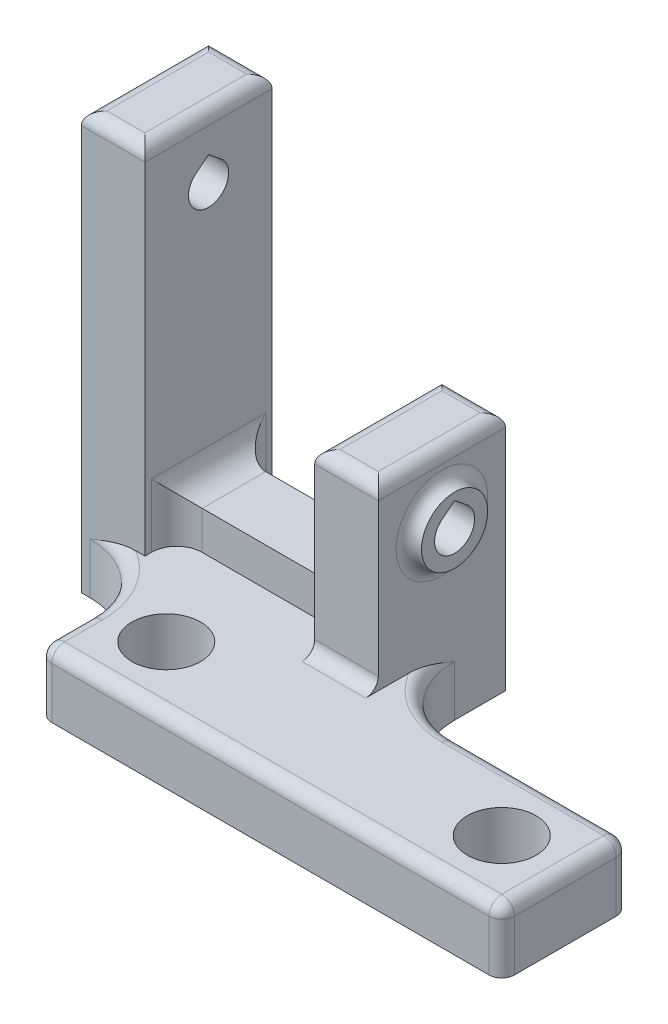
ISO-10303-21;
HEADER;
FILE_DESCRIPTION(('STEP AP214'),'2;1');
FILE_NAME('part.step','',(''),(''),'','','');
FILE_SCHEMA(('AUTOMOTIVE_DESIGN { 1 0 10303 214 1 1 1 1 }'));
ENDSEC;
DATA;
#1=APPLICATION_CONTEXT('core data for automotive mechanical design processes');
#2=APPLICATION_PROTOCOL_DEFINITION('international standard','automotive_design',2000,#1);
#3=PRODUCT_CONTEXT('',#1,'mechanical');
#4=PRODUCT('Part','Part','',(#3));
#5=PRODUCT_RELATED_PRODUCT_CATEGORY('part','',(#4));
#6=PRODUCT_DEFINITION_FORMATION('','',#4);
#7=PRODUCT_DEFINITION_CONTEXT('part definition',#1,'design');
#8=PRODUCT_DEFINITION('design','',#6,#7);
#9=PRODUCT_DEFINITION_SHAPE('','',#8);
#10=(LENGTH_UNIT() NAMED_UNIT(*) SI_UNIT(.MILLI.,.METRE.));
#11=(NAMED_UNIT(*) PLANE_ANGLE_UNIT() SI_UNIT($,.RADIAN.));
#12=(NAMED_UNIT(*) SI_UNIT($,.STERADIAN.) SOLID_ANGLE_UNIT());
#13=UNCERTAINTY_MEASURE_WITH_UNIT(LENGTH_MEASURE(1.E-05),#10,'distance_accuracy_value','');
#14=(GEOMETRIC_REPRESENTATION_CONTEXT(3) GLOBAL_UNCERTAINTY_ASSIGNED_CONTEXT((#13)) GLOBAL_UNIT_ASSIGNED_CONTEXT((#10,
#11,#12)) REPRESENTATION_CONTEXT('',''));
#15=CARTESIAN_POINT('',(0.,0.,0.));
#16=DIRECTION('',(0.,0.,1.));
#17=DIRECTION('',(1.,0.,0.));
#18=AXIS2_PLACEMENT_3D('',#15,#16,#17);
#19=CARTESIAN_POINT('',(31.0836785,32.16148,6.35));
#20=DIRECTION('',(-1.,0.,0.));
#21=DIRECTION('',(0.,0.,1.));
#22=AXIS2_PLACEMENT_3D('',#19,#20,#21);
#23=CYLINDRICAL_SURFACE('',#22,2.);
#24=DIRECTION('',(1.,0.,0.));
#25=VECTOR('',#24,1.);
#26=CARTESIAN_POINT('',(-18.7885572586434,33.7230328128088,5.10037893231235));
#27=LINE('',#26,#25);
#28=CARTESIAN_POINT('',(-16.0966785,33.7230328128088,5.10037893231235));
#29=VERTEX_POINT('',#28);
#30=CARTESIAN_POINT('',(-8.47667849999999,33.7230328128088,5.10037893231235));
#31=VERTEX_POINT('',#30);
#32=EDGE_CURVE('E330',#29,#31,#27,.T.);
#33=ORIENTED_EDGE('',*,*,#32,.F.);
#34=CARTESIAN_POINT('',(-16.0966785,32.16148,6.35));
#35=DIRECTION('',(-1.,0.,0.));
#36=DIRECTION('',(0.,0.,1.));
#37=AXIS2_PLACEMENT_3D('',#34,#35,#36);
#38=CIRCLE('',#37,2.);
#39=CARTESIAN_POINT('',(-16.0966785,33.7230328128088,7.59962106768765));
#40=VERTEX_POINT('',#39);
#41=EDGE_CURVE('E344',#29,#40,#38,.T.);
#42=ORIENTED_EDGE('',*,*,#41,.T.);
#43=DIRECTION('',(1.,0.,0.));
#44=VECTOR('',#43,1.);
#45=CARTESIAN_POINT('',(-18.7885572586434,33.7230328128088,7.59962106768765));
#46=LINE('',#45,#44);
#47=CARTESIAN_POINT('',(-8.47667849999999,33.7230328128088,7.59962106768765));
#48=VERTEX_POINT('',#47);
#49=EDGE_CURVE('E335',#40,#48,#46,.T.);
#50=ORIENTED_EDGE('',*,*,#49,.T.);
#51=CARTESIAN_POINT('',(-8.47667849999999,32.16148,6.35));
#52=DIRECTION('',(1.,0.,0.));
#53=DIRECTION('',(0.,1.,0.));
#54=AXIS2_PLACEMENT_3D('',#51,#52,#53);
#55=CIRCLE('',#54,2.);
#56=EDGE_CURVE('E382',#31,#48,#55,.F.);
#57=ORIENTED_EDGE('',*,*,#56,.F.);
#58=EDGE_LOOP('',(#33,#42,#50,#57));
#59=FACE_BOUND('',#58,.T.);
#60=ADVANCED_FACE('F35',(#59),#23,.F.);
#61=CARTESIAN_POINT('',(-14.8266785,0.,12.7));
#62=DIRECTION('',(-1.,0.,0.));
#63=DIRECTION('',(0.,0.,1.));
#64=AXIS2_PLACEMENT_3D('',#61,#62,#63);
#65=PLANE('',#64);
#66=CARTESIAN_POINT('',(-14.8266785,32.16148,6.35));
#67=DIRECTION('',(-1.,0.,0.));
#68=DIRECTION('',(0.,0.,1.));
#69=AXIS2_PLACEMENT_3D('',#66,#67,#68);
#70=CIRCLE('',#69,4.572);
#71=CARTESIAN_POINT('',(-14.8266785,32.16148,10.922));
#72=VERTEX_POINT('',#71);
#73=EDGE_CURVE('E535',#72,#72,#70,.F.);
#74=ORIENTED_EDGE('',*,*,#73,.T.);
#75=EDGE_LOOP('',(#74));
#76=FACE_BOUND('',#75,.T.);
#77=DIRECTION('',(0.,1.,0.));
#78=VECTOR('',#77,1.);
#79=CARTESIAN_POINT('',(-14.8266785,0.,12.7));
#80=LINE('',#79,#78);
#81=CARTESIAN_POINT('',(-14.8266785,-3.175,12.7));
#82=VERTEX_POINT('',#81);
#83=CARTESIAN_POINT('',(-14.8266785,37.24148,12.7));
#84=VERTEX_POINT('',#83);
#85=EDGE_CURVE('E396',#82,#84,#80,.T.);
#86=ORIENTED_EDGE('',*,*,#85,.T.);
#87=DIRECTION('',(0.,0.,-1.));
#88=VECTOR('',#87,1.);
#89=CARTESIAN_POINT('',(-14.8266785,37.24148,0.));
#90=LINE('',#89,#88);
#91=CARTESIAN_POINT('',(-14.8266785,37.24148,0.));
#92=VERTEX_POINT('',#91);
#93=EDGE_CURVE('E485',#84,#92,#90,.T.);
#94=ORIENTED_EDGE('',*,*,#93,.T.);
#95=DIRECTION('',(0.,1.,0.));
#96=VECTOR('',#95,1.);
#97=CARTESIAN_POINT('',(-14.8266785,0.,0.));
#98=LINE('',#97,#96);
#99=CARTESIAN_POINT('',(-14.8266785,-3.175,0.));
#100=VERTEX_POINT('',#99);
#101=EDGE_CURVE('E411',#100,#92,#98,.T.);
#102=ORIENTED_EDGE('',*,*,#101,.F.);
#103=DIRECTION('',(0.,0.,-1.));
#104=VECTOR('',#103,1.);
#105=CARTESIAN_POINT('',(-14.8266785,-3.175,-2.5417821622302));
#106=LINE('',#105,#104);
#107=EDGE_CURVE('E369',#82,#100,#106,.T.);
#108=ORIENTED_EDGE('',*,*,#107,.F.);
#109=EDGE_LOOP('',(#86,#94,#102,#108));
#110=FACE_BOUND('',#109,.T.);
#111=ADVANCED_FACE('F682',(#76,#110),#65,.T.);
#112=CARTESIAN_POINT('',(14.8266785,0.,12.7));
#113=DIRECTION('',(-1.,0.,0.));
#114=DIRECTION('',(0.,0.,1.));
#115=AXIS2_PLACEMENT_3D('',#112,#113,#114);
#116=PLANE('',#115);
#117=CARTESIAN_POINT('',(14.8266785,14.52372,6.35));
#118=DIRECTION('',(-1.,0.,0.));
#119=DIRECTION('',(0.,0.,1.));
#120=AXIS2_PLACEMENT_3D('',#117,#118,#119);
#121=CIRCLE('',#120,4.572);
#122=CARTESIAN_POINT('',(14.8266785,14.52372,10.922));
#123=VERTEX_POINT('',#122);
#124=EDGE_CURVE('E510',#123,#123,#121,.T.);
#125=ORIENTED_EDGE('',*,*,#124,.T.);
#126=EDGE_LOOP('',(#125));
#127=FACE_BOUND('',#126,.T.);
#128=DIRECTION('',(0.,1.,0.));
#129=VECTOR('',#128,1.);
#130=CARTESIAN_POINT('',(14.8266785,0.,12.7));
#131=LINE('',#130,#129);
#132=CARTESIAN_POINT('',(14.8266785,4.445,12.7));
#133=VERTEX_POINT('',#132);
#134=CARTESIAN_POINT('',(14.8266785,19.60372,12.7));
#135=VERTEX_POINT('',#134);
#136=EDGE_CURVE('E402',#133,#135,#131,.T.);
#137=ORIENTED_EDGE('',*,*,#136,.F.);
#138=CARTESIAN_POINT('',(14.8266785,4.445,13.97));
#139=DIRECTION('',(-1.,0.,0.));
#140=DIRECTION('',(0.,0.,1.));
#141=AXIS2_PLACEMENT_3D('',#138,#139,#140);
#142=CIRCLE('',#141,1.27);
#143=CARTESIAN_POINT('',(14.8266785,3.175,13.97));
#144=VERTEX_POINT('',#143);
#145=EDGE_CURVE('E11',#133,#144,#142,.T.);
#146=ORIENTED_EDGE('',*,*,#145,.T.);
#147=DIRECTION('',(0.,0.,-1.));
#148=VECTOR('',#147,1.);
#149=CARTESIAN_POINT('',(14.8266785,3.175,12.7));
#150=LINE('',#149,#148);
#151=CARTESIAN_POINT('',(14.8266785,3.175,9.65905011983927));
#152=VERTEX_POINT('',#151);
#153=EDGE_CURVE('E543',#144,#152,#150,.T.);
#154=ORIENTED_EDGE('',*,*,#153,.T.);
#155=CARTESIAN_POINT('',(14.8266785,3.175,9.65905011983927));
#156=CARTESIAN_POINT('',(14.8266785,3.17498529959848,9.5699291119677));
#157=CARTESIAN_POINT('',(14.8266785,3.17251203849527,9.48083769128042));
#158=CARTESIAN_POINT('',(14.8266785,3.16317888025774,9.30293342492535));
#159=CARTESIAN_POINT('',(14.8266785,3.15632157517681,9.21412044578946));
#160=CARTESIAN_POINT('',(14.8266785,3.13877362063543,9.03712957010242));
#161=CARTESIAN_POINT('',(14.8266785,3.12809352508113,8.94895060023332));
#162=CARTESIAN_POINT('',(14.8266785,3.10332919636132,8.7730635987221));
#163=CARTESIAN_POINT('',(14.8266785,3.08924440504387,8.68535564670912));
#164=CARTESIAN_POINT('',(14.8266785,3.04277992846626,8.42474517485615));
#165=CARTESIAN_POINT('',(14.8266785,3.00600197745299,8.25262111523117));
#166=CARTESIAN_POINT('',(14.8266785,2.92315887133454,7.91053976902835));
#167=CARTESIAN_POINT('',(14.8266785,2.87708628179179,7.74058433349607));
#168=CARTESIAN_POINT('',(14.8266785,2.7653927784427,7.36084020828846));
#169=CARTESIAN_POINT('',(14.8266785,2.69775923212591,7.15164861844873));
#170=CARTESIAN_POINT('',(14.8266785,2.55459543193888,6.73596921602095));
#171=CARTESIAN_POINT('',(14.8266785,2.47906294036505,6.52948218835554));
#172=CARTESIAN_POINT('',(14.8266785,2.24461209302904,5.91207040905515));
#173=CARTESIAN_POINT('',(14.8266785,2.07812323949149,5.50406611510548));
#174=CARTESIAN_POINT('',(14.8266785,1.90939911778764,5.09077562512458));
#175=CARTESIAN_POINT('',(14.8266785,1.90719955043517,5.0853878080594));
#176=CARTESIAN_POINT('',(14.8266785,1.905,5.08));
#177=B_SPLINE_CURVE_WITH_KNOTS('',3,(#155,#156,#157,#158,#159,#160,#161,#162,#163,#164,#165,
#166,#167,#168,#169,#170,#171,#172,#173,#174,#175,#176),.UNSPECIFIED.,.F.,.F.,(4,2,2,2,2,2,2,2,
2,2,4),(0.,0.267286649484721,0.534415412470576,0.800812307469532,1.06725290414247,
1.59491100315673,2.12299284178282,2.78230932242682,3.44181309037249,4.76356437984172,
4.78102290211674),.UNSPECIFIED.);
#178=CARTESIAN_POINT('',(14.8266785,1.905,5.08));
#179=VERTEX_POINT('',#178);
#180=EDGE_CURVE('E613',#152,#179,#177,.T.);
#181=ORIENTED_EDGE('',*,*,#180,.T.);
#182=DIRECTION('',(0.,1.,0.));
#183=VECTOR('',#182,1.);
#184=CARTESIAN_POINT('',(14.8266785,0.,5.08));
#185=LINE('',#184,#183);
#186=CARTESIAN_POINT('',(14.8266785,-3.175,5.08));
#187=VERTEX_POINT('',#186);
#188=EDGE_CURVE('E541',#179,#187,#185,.F.);
#189=ORIENTED_EDGE('',*,*,#188,.T.);
#190=DIRECTION('',(0.,0.,1.));
#191=VECTOR('',#190,1.);
#192=CARTESIAN_POINT('',(14.8266785,-3.175,-4.33392430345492));
#193=LINE('',#192,#191);
#194=CARTESIAN_POINT('',(14.8266785,-3.175,0.));
#195=VERTEX_POINT('',#194);
#196=EDGE_CURVE('E362',#195,#187,#193,.T.);
#197=ORIENTED_EDGE('',*,*,#196,.F.);
#198=DIRECTION('',(0.,1.,0.));
#199=VECTOR('',#198,1.);
#200=CARTESIAN_POINT('',(14.8266785,0.,0.));
#201=LINE('',#200,#199);
#202=CARTESIAN_POINT('',(14.8266785,19.60372,0.));
#203=VERTEX_POINT('',#202);
#204=EDGE_CURVE('E416',#195,#203,#201,.T.);
#205=ORIENTED_EDGE('',*,*,#204,.T.);
#206=DIRECTION('',(0.,0.,-1.));
#207=VECTOR('',#206,1.);
#208=CARTESIAN_POINT('',(14.8266785,19.60372,12.7));
#209=LINE('',#208,#207);
#210=EDGE_CURVE('E499',#203,#135,#209,.F.);
#211=ORIENTED_EDGE('',*,*,#210,.T.);
#212=EDGE_LOOP('',(#137,#146,#154,#181,#189,#197,#205,#211));
#213=FACE_BOUND('',#212,.T.);
#214=ADVANCED_FACE('F688',(#127,#213),#116,.F.);
#215=CARTESIAN_POINT('',(0.,3.175,12.7));
#216=DIRECTION('',(0.,-1.,0.));
#217=DIRECTION('',(1.,0.,0.));
#218=AXIS2_PLACEMENT_3D('',#215,#216,#217);
#219=PLANE('',#218);
#220=DIRECTION('',(1.,0.,0.));
#221=VECTOR('',#220,1.);
#222=CARTESIAN_POINT('',(0.,3.175,12.7));
#223=LINE('',#222,#221);
#224=CARTESIAN_POINT('',(-9.39094988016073,3.175,12.7));
#225=VERTEX_POINT('',#224);
#226=CARTESIAN_POINT('',(-8.4766785,3.175,12.7));
#227=VERTEX_POINT('',#226);
#228=EDGE_CURVE('E546',#225,#227,#223,.T.);
#229=ORIENTED_EDGE('',*,*,#228,.F.);
#230=CARTESIAN_POINT('',(-13.97,3.175,20.32));
#231=DIRECTION('',(0.,-1.,0.));
#232=DIRECTION('',(1.,0.,0.));
#233=AXIS2_PLACEMENT_3D('',#230,#231,#232);
#234=CIRCLE('',#233,8.89);
#235=CARTESIAN_POINT('',(-5.08,3.175,20.32));
#236=VERTEX_POINT('',#235);
#237=EDGE_CURVE('E571',#225,#236,#234,.T.);
#238=ORIENTED_EDGE('',*,*,#237,.T.);
#239=DIRECTION('',(0.,0.,1.));
#240=VECTOR('',#239,1.);
#241=CARTESIAN_POINT('',(-5.08,3.175,25.4));
#242=LINE('',#241,#240);
#243=CARTESIAN_POINT('',(-5.08,3.175,24.13));
#244=VERTEX_POINT('',#243);
#245=EDGE_CURVE('E567',#236,#244,#242,.T.);
#246=ORIENTED_EDGE('',*,*,#245,.T.);
#247=DIRECTION('',(1.,0.,0.));
#248=VECTOR('',#247,1.);
#249=CARTESIAN_POINT('',(39.855648,3.17500000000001,24.13));
#250=LINE('',#249,#248);
#251=CARTESIAN_POINT('',(38.585648,3.175,24.13));
#252=VERTEX_POINT('',#251);
#253=EDGE_CURVE('E561',#244,#252,#250,.T.);
#254=ORIENTED_EDGE('',*,*,#253,.T.);
#255=DIRECTION('',(0.,0.,-1.));
#256=VECTOR('',#255,1.);
#257=CARTESIAN_POINT('',(38.585648,3.17500000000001,12.7));
#258=LINE('',#257,#256);
#259=CARTESIAN_POINT('',(38.585648,3.175,13.97));
#260=VERTEX_POINT('',#259);
#261=EDGE_CURVE('E563',#252,#260,#258,.T.);
#262=ORIENTED_EDGE('',*,*,#261,.T.);
#263=DIRECTION('',(-1.,0.,0.));
#264=VECTOR('',#263,1.);
#265=CARTESIAN_POINT('',(22.4466785,3.175,13.97));
#266=LINE('',#265,#264);
#267=CARTESIAN_POINT('',(22.4466785,3.175,13.97));
#268=VERTEX_POINT('',#267);
#269=EDGE_CURVE('E565',#260,#268,#266,.T.);
#270=ORIENTED_EDGE('',*,*,#269,.T.);
#271=CARTESIAN_POINT('',(22.4466785,3.175,5.08));
#272=DIRECTION('',(0.,-1.,0.));
#273=DIRECTION('',(1.,0.,0.));
#274=AXIS2_PLACEMENT_3D('',#271,#272,#273);
#275=CIRCLE('',#274,8.89);
#276=EDGE_CURVE('E569',#268,#152,#275,.T.);
#277=ORIENTED_EDGE('',*,*,#276,.T.);
#278=ORIENTED_EDGE('',*,*,#153,.F.);
#279=DIRECTION('',(-1.,0.,0.));
#280=VECTOR('',#279,1.);
#281=CARTESIAN_POINT('',(0.,3.175,13.97));
#282=LINE('',#281,#280);
#283=CARTESIAN_POINT('',(8.4766785,3.175,13.97));
#284=VERTEX_POINT('',#283);
#285=EDGE_CURVE('E558',#144,#284,#282,.T.);
#286=ORIENTED_EDGE('',*,*,#285,.T.);
#287=DIRECTION('',(0.,0.,-1.));
#288=VECTOR('',#287,1.);
#289=CARTESIAN_POINT('',(8.4766785,3.175,12.7));
#290=LINE('',#289,#288);
#291=CARTESIAN_POINT('',(8.4766785,3.175,12.065));
#292=VERTEX_POINT('',#291);
#293=EDGE_CURVE('E420',#284,#292,#290,.T.);
#294=ORIENTED_EDGE('',*,*,#293,.T.);
#295=CARTESIAN_POINT('',(5.9366785,3.175,12.065));
#296=DIRECTION('',(0.,-1.,0.));
#297=DIRECTION('',(1.,0.,0.));
#298=AXIS2_PLACEMENT_3D('',#295,#296,#297);
#299=CIRCLE('',#298,2.54);
#300=CARTESIAN_POINT('',(5.9366785,3.175,9.525));
#301=VERTEX_POINT('',#300);
#302=EDGE_CURVE('E444',#292,#301,#299,.F.);
#303=ORIENTED_EDGE('',*,*,#302,.T.);
#304=DIRECTION('',(1.,0.,0.));
#305=VECTOR('',#304,1.);
#306=CARTESIAN_POINT('',(-8.4766785,3.175,9.525));
#307=LINE('',#306,#305);
#308=CARTESIAN_POINT('',(-5.9366785,3.175,9.525));
#309=VERTEX_POINT('',#308);
#310=EDGE_CURVE('E363',#309,#301,#307,.T.);
#311=ORIENTED_EDGE('',*,*,#310,.F.);
#312=CARTESIAN_POINT('',(-5.9366785,3.175,12.065));
#313=DIRECTION('',(0.,-1.,0.));
#314=DIRECTION('',(1.,0.,0.));
#315=AXIS2_PLACEMENT_3D('',#312,#313,#314);
#316=CIRCLE('',#315,2.54);
#317=CARTESIAN_POINT('',(-8.4766785,3.175,12.065));
#318=VERTEX_POINT('',#317);
#319=EDGE_CURVE('E442',#309,#318,#316,.F.);
#320=ORIENTED_EDGE('',*,*,#319,.T.);
#321=DIRECTION('',(0.,0.,-1.));
#322=VECTOR('',#321,1.);
#323=CARTESIAN_POINT('',(-8.4766785,3.175,12.7));
#324=LINE('',#323,#322);
#325=EDGE_CURVE('E424',#227,#318,#324,.T.);
#326=ORIENTED_EDGE('',*,*,#325,.F.);
#327=EDGE_LOOP('',(#229,#238,#246,#254,#262,#270,#277,#278,#286,#294,#303,#311,#320,#326));
#328=FACE_BOUND('',#327,.T.);
#329=CARTESIAN_POINT('',(0.,3.175,19.05));
#330=DIRECTION('',(0.,1.,0.));
#331=DIRECTION('',(-1.,0.,0.));
#332=AXIS2_PLACEMENT_3D('',#329,#330,#331);
#333=CIRCLE('',#332,3.429);
#334=CARTESIAN_POINT('',(-3.429,3.175,19.05));
#335=VERTEX_POINT('',#334);
#336=EDGE_CURVE('E375',#335,#335,#333,.T.);
#337=ORIENTED_EDGE('',*,*,#336,.F.);
#338=EDGE_LOOP('',(#337));
#339=FACE_BOUND('',#338,.T.);
#340=CARTESIAN_POINT('',(33.505648,3.175,19.05));
#341=DIRECTION('',(0.,1.,0.));
#342=DIRECTION('',(-1.,0.,0.));
#343=AXIS2_PLACEMENT_3D('',#340,#341,#342);
#344=CIRCLE('',#343,3.429);
#345=CARTESIAN_POINT('',(30.076648,3.175,19.05));
#346=VERTEX_POINT('',#345);
#347=EDGE_CURVE('E838',#346,#346,#344,.T.);
#348=ORIENTED_EDGE('',*,*,#347,.F.);
#349=EDGE_LOOP('',(#348));
#350=FACE_BOUND('',#349,.T.);
#351=ADVANCED_FACE('F721',(#328,#339,#350),#219,.F.);
#352=DIRECTION('',(-1.,0.,0.));
#353=VECTOR('',#352,1.);
#354=CARTESIAN_POINT('',(0.,3.175,0.));
#355=LINE('',#354,#353);
#356=CARTESIAN_POINT('',(8.4766785,3.175,0.));
#357=VERTEX_POINT('',#356);
#358=CARTESIAN_POINT('',(-8.4766785,3.175,0.));
#359=VERTEX_POINT('',#358);
#360=EDGE_CURVE('E392',#357,#359,#355,.T.);
#361=ORIENTED_EDGE('',*,*,#360,.T.);
#362=CARTESIAN_POINT('',(-8.4766785,3.175,0.635));
#363=VERTEX_POINT('',#362);
#364=EDGE_CURVE('E423',#363,#359,#324,.T.);
#365=ORIENTED_EDGE('',*,*,#364,.F.);
#366=CARTESIAN_POINT('',(-5.9366785,3.175,0.635));
#367=DIRECTION('',(0.,-1.,0.));
#368=DIRECTION('',(1.,0.,0.));
#369=AXIS2_PLACEMENT_3D('',#366,#367,#368);
#370=CIRCLE('',#369,2.54);
#371=CARTESIAN_POINT('',(-5.9366785,3.175,3.175));
#372=VERTEX_POINT('',#371);
#373=EDGE_CURVE('E432',#363,#372,#370,.F.);
#374=ORIENTED_EDGE('',*,*,#373,.T.);
#375=DIRECTION('',(-1.,0.,0.));
#376=VECTOR('',#375,1.);
#377=CARTESIAN_POINT('',(-8.4766785,3.175,3.175));
#378=LINE('',#377,#376);
#379=CARTESIAN_POINT('',(5.9366785,3.175,3.175));
#380=VERTEX_POINT('',#379);
#381=EDGE_CURVE('E359',#380,#372,#378,.T.);
#382=ORIENTED_EDGE('',*,*,#381,.F.);
#383=CARTESIAN_POINT('',(5.9366785,3.175,0.635000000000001));
#384=DIRECTION('',(0.,-1.,0.));
#385=DIRECTION('',(1.,0.,0.));
#386=AXIS2_PLACEMENT_3D('',#383,#384,#385);
#387=CIRCLE('',#386,2.54);
#388=CARTESIAN_POINT('',(8.4766785,3.175,0.635));
#389=VERTEX_POINT('',#388);
#390=EDGE_CURVE('E434',#380,#389,#387,.F.);
#391=ORIENTED_EDGE('',*,*,#390,.T.);
#392=EDGE_CURVE('E406',#389,#357,#290,.T.);
#393=ORIENTED_EDGE('',*,*,#392,.T.);
#394=EDGE_LOOP('',(#361,#365,#374,#382,#391,#393));
#395=FACE_BOUND('',#394,.T.);
#396=ADVANCED_FACE('F750',(#395),#219,.F.);
#397=CARTESIAN_POINT('',(-8.4766785,0.,12.7));
#398=DIRECTION('',(1.,0.,0.));
#399=DIRECTION('',(0.,1.,0.));
#400=AXIS2_PLACEMENT_3D('',#397,#398,#399);
#401=PLANE('',#400);
#402=DIRECTION('',(0.,0.624810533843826,0.780776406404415));
#403=VECTOR('',#402,1.);
#404=CARTESIAN_POINT('',(-8.47667849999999,34.7230328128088,6.35));
#405=LINE('',#404,#403);
#406=CARTESIAN_POINT('',(-8.47667849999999,34.7230328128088,6.35));
#407=VERTEX_POINT('',#406);
#408=EDGE_CURVE('E327',#31,#407,#405,.T.);
#409=ORIENTED_EDGE('',*,*,#408,.F.);
#410=ORIENTED_EDGE('',*,*,#56,.T.);
#411=DIRECTION('',(0.,-0.624810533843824,0.780776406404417));
#412=VECTOR('',#411,1.);
#413=CARTESIAN_POINT('',(-8.47667849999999,33.7230328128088,7.59962106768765));
#414=LINE('',#413,#412);
#415=EDGE_CURVE('E326',#407,#48,#414,.T.);
#416=ORIENTED_EDGE('',*,*,#415,.F.);
#417=EDGE_LOOP('',(#409,#410,#416));
#418=FACE_BOUND('',#417,.T.);
#419=DIRECTION('',(0.,-1.,0.));
#420=VECTOR('',#419,1.);
#421=CARTESIAN_POINT('',(-8.4766785,0.,0.));
#422=LINE('',#421,#420);
#423=CARTESIAN_POINT('',(-8.47667849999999,37.24148,0.));
#424=VERTEX_POINT('',#423);
#425=EDGE_CURVE('E408',#424,#359,#422,.T.);
#426=ORIENTED_EDGE('',*,*,#425,.F.);
#427=DIRECTION('',(0.,0.,-1.));
#428=VECTOR('',#427,1.);
#429=CARTESIAN_POINT('',(-8.47667849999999,37.24148,12.7));
#430=LINE('',#429,#428);
#431=CARTESIAN_POINT('',(-8.47667849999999,37.24148,12.7));
#432=VERTEX_POINT('',#431);
#433=EDGE_CURVE('E480',#424,#432,#430,.F.);
#434=ORIENTED_EDGE('',*,*,#433,.T.);
#435=DIRECTION('',(0.,-1.,0.));
#436=VECTOR('',#435,1.);
#437=CARTESIAN_POINT('',(-8.4766785,0.,12.7));
#438=LINE('',#437,#436);
#439=EDGE_CURVE('E393',#432,#227,#438,.T.);
#440=ORIENTED_EDGE('',*,*,#439,.T.);
#441=ORIENTED_EDGE('',*,*,#325,.T.);
#442=DIRECTION('',(0.,-1.,0.));
#443=VECTOR('',#442,1.);
#444=CARTESIAN_POINT('',(-8.4766785,0.,12.065));
#445=LINE('',#444,#443);
#446=CARTESIAN_POINT('',(-8.4766785,9.525,12.065));
#447=VERTEX_POINT('',#446);
#448=EDGE_CURVE('E456',#318,#447,#445,.F.);
#449=ORIENTED_EDGE('',*,*,#448,.T.);
#450=DIRECTION('',(0.,0.,1.));
#451=VECTOR('',#450,1.);
#452=CARTESIAN_POINT('',(-8.4766785,9.525,3.175));
#453=LINE('',#452,#451);
#454=CARTESIAN_POINT('',(-8.4766785,9.525,0.635));
#455=VERTEX_POINT('',#454);
#456=EDGE_CURVE('E454',#447,#455,#453,.F.);
#457=ORIENTED_EDGE('',*,*,#456,.T.);
#458=DIRECTION('',(0.,-1.,0.));
#459=VECTOR('',#458,1.);
#460=CARTESIAN_POINT('',(-8.4766785,0.,0.635));
#461=LINE('',#460,#459);
#462=EDGE_CURVE('E458',#455,#363,#461,.T.);
#463=ORIENTED_EDGE('',*,*,#462,.T.);
#464=ORIENTED_EDGE('',*,*,#364,.T.);
#465=EDGE_LOOP('',(#426,#434,#440,#441,#449,#457,#463,#464));
#466=FACE_BOUND('',#465,.T.);
#467=ADVANCED_FACE('F712',(#418,#466),#401,.T.);
#468=CARTESIAN_POINT('',(8.4766785,0.,12.7));
#469=DIRECTION('',(-1.,0.,0.));
#470=DIRECTION('',(0.,0.,1.));
#471=AXIS2_PLACEMENT_3D('',#468,#469,#470);
#472=PLANE('',#471);
#473=DIRECTION('',(0.,0.624810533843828,-0.780776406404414));
#474=VECTOR('',#473,1.);
#475=CARTESIAN_POINT('',(8.4766785,17.0852728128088,6.35));
#476=LINE('',#475,#474);
#477=CARTESIAN_POINT('',(8.4766785,16.0852728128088,7.59962106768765));
#478=VERTEX_POINT('',#477);
#479=CARTESIAN_POINT('',(8.4766785,17.0852728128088,6.35));
#480=VERTEX_POINT('',#479);
#481=EDGE_CURVE('E312',#478,#480,#476,.T.);
#482=ORIENTED_EDGE('',*,*,#481,.F.);
#483=CARTESIAN_POINT('',(8.4766785,14.52372,6.35));
#484=DIRECTION('',(-1.,0.,0.));
#485=DIRECTION('',(0.,0.,1.));
#486=AXIS2_PLACEMENT_3D('',#483,#484,#485);
#487=CIRCLE('',#486,2.);
#488=CARTESIAN_POINT('',(8.4766785,16.0852728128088,5.10037893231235));
#489=VERTEX_POINT('',#488);
#490=EDGE_CURVE('E389',#478,#489,#487,.F.);
#491=ORIENTED_EDGE('',*,*,#490,.T.);
#492=DIRECTION('',(0.,-0.624810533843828,-0.780776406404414));
#493=VECTOR('',#492,1.);
#494=CARTESIAN_POINT('',(8.4766785,16.0852728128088,5.10037893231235));
#495=LINE('',#494,#493);
#496=EDGE_CURVE('E318',#480,#489,#495,.T.);
#497=ORIENTED_EDGE('',*,*,#496,.F.);
#498=EDGE_LOOP('',(#482,#491,#497));
#499=FACE_BOUND('',#498,.T.);
#500=ORIENTED_EDGE('',*,*,#293,.F.);
#501=CARTESIAN_POINT('',(8.4766785,4.445,13.97));
#502=DIRECTION('',(-1.,0.,0.));
#503=DIRECTION('',(0.,0.,1.));
#504=AXIS2_PLACEMENT_3D('',#501,#502,#503);
#505=CIRCLE('',#504,1.27);
#506=CARTESIAN_POINT('',(8.4766785,4.445,12.7));
#507=VERTEX_POINT('',#506);
#508=EDGE_CURVE('E44',#284,#507,#505,.F.);
#509=ORIENTED_EDGE('',*,*,#508,.T.);
#510=DIRECTION('',(0.,1.,0.));
#511=VECTOR('',#510,1.);
#512=CARTESIAN_POINT('',(8.4766785,0.,12.7));
#513=LINE('',#512,#511);
#514=CARTESIAN_POINT('',(8.4766785,19.60372,12.7));
#515=VERTEX_POINT('',#514);
#516=EDGE_CURVE('E404',#507,#515,#513,.T.);
#517=ORIENTED_EDGE('',*,*,#516,.T.);
#518=DIRECTION('',(0.,0.,-1.));
#519=VECTOR('',#518,1.);
#520=CARTESIAN_POINT('',(8.4766785,19.60372,12.7));
#521=LINE('',#520,#519);
#522=CARTESIAN_POINT('',(8.4766785,19.60372,0.));
#523=VERTEX_POINT('',#522);
#524=EDGE_CURVE('E505',#515,#523,#521,.T.);
#525=ORIENTED_EDGE('',*,*,#524,.T.);
#526=DIRECTION('',(0.,1.,0.));
#527=VECTOR('',#526,1.);
#528=CARTESIAN_POINT('',(8.4766785,0.,0.));
#529=LINE('',#528,#527);
#530=EDGE_CURVE('E397',#357,#523,#529,.T.);
#531=ORIENTED_EDGE('',*,*,#530,.F.);
#532=ORIENTED_EDGE('',*,*,#392,.F.);
#533=DIRECTION('',(0.,-1.,0.));
#534=VECTOR('',#533,1.);
#535=CARTESIAN_POINT('',(8.4766785,0.,0.635));
#536=LINE('',#535,#534);
#537=CARTESIAN_POINT('',(8.4766785,9.525,0.635000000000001));
#538=VERTEX_POINT('',#537);
#539=EDGE_CURVE('E440',#389,#538,#536,.F.);
#540=ORIENTED_EDGE('',*,*,#539,.T.);
#541=DIRECTION('',(0.,0.,-1.));
#542=VECTOR('',#541,1.);
#543=CARTESIAN_POINT('',(8.4766785,9.525,9.525));
#544=LINE('',#543,#542);
#545=CARTESIAN_POINT('',(8.4766785,9.525,12.065));
#546=VERTEX_POINT('',#545);
#547=EDGE_CURVE('E436',#538,#546,#544,.F.);
#548=ORIENTED_EDGE('',*,*,#547,.T.);
#549=DIRECTION('',(0.,-1.,0.));
#550=VECTOR('',#549,1.);
#551=CARTESIAN_POINT('',(8.4766785,0.,12.065));
#552=LINE('',#551,#550);
#553=EDGE_CURVE('E438',#546,#292,#552,.T.);
#554=ORIENTED_EDGE('',*,*,#553,.T.);
#555=EDGE_LOOP('',(#500,#509,#517,#525,#531,#532,#540,#548,#554));
#556=FACE_BOUND('',#555,.T.);
#557=ADVANCED_FACE('F709',(#499,#556),#472,.T.);
#558=CARTESIAN_POINT('',(0.,0.,12.7));
#559=DIRECTION('',(0.,0.,1.));
#560=DIRECTION('',(1.,0.,0.));
#561=AXIS2_PLACEMENT_3D('',#558,#559,#560);
#562=PLANE('',#561);
#563=DIRECTION('',(-1.,0.,0.));
#564=VECTOR('',#563,1.);
#565=CARTESIAN_POINT('',(0.,-3.175,12.7));
#566=LINE('',#565,#564);
#567=CARTESIAN_POINT('',(-13.97,-3.175,12.7));
#568=VERTEX_POINT('',#567);
#569=EDGE_CURVE('E400',#568,#82,#566,.T.);
#570=ORIENTED_EDGE('',*,*,#569,.F.);
#571=DIRECTION('',(0.,1.,0.));
#572=VECTOR('',#571,1.);
#573=CARTESIAN_POINT('',(-13.97,3.175,12.7));
#574=LINE('',#573,#572);
#575=CARTESIAN_POINT('',(-13.97,1.905,12.7));
#576=VERTEX_POINT('',#575);
#577=EDGE_CURVE('E548',#568,#576,#574,.T.);
#578=ORIENTED_EDGE('',*,*,#577,.T.);
#579=CARTESIAN_POINT('',(-9.39094988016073,3.175,12.7));
#580=CARTESIAN_POINT('',(-9.4800708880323,3.17498529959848,12.7));
#581=CARTESIAN_POINT('',(-9.56916230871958,3.17251203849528,12.7));
#582=CARTESIAN_POINT('',(-9.74706657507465,3.16317888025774,12.7));
#583=CARTESIAN_POINT('',(-9.83587955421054,3.15632157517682,12.7));
#584=CARTESIAN_POINT('',(-10.0128704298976,3.13877362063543,12.7));
#585=CARTESIAN_POINT('',(-10.1010493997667,3.12809352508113,12.7));
#586=CARTESIAN_POINT('',(-10.2769364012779,3.10332919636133,12.7));
#587=CARTESIAN_POINT('',(-10.3646443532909,3.08924440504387,12.7));
#588=CARTESIAN_POINT('',(-10.6252548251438,3.04277992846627,12.7));
#589=CARTESIAN_POINT('',(-10.7973788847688,3.00600197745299,12.7));
#590=CARTESIAN_POINT('',(-11.1394602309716,2.92315887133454,12.7));
#591=CARTESIAN_POINT('',(-11.3094156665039,2.8770862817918,12.7));
#592=CARTESIAN_POINT('',(-11.6891597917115,2.7653927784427,12.7));
#593=CARTESIAN_POINT('',(-11.8983513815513,2.69775923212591,12.7));
#594=CARTESIAN_POINT('',(-12.314030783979,2.55459543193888,12.7));
#595=CARTESIAN_POINT('',(-12.5205178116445,2.47906294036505,12.7));
#596=CARTESIAN_POINT('',(-13.1379295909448,2.24461209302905,12.7));
#597=CARTESIAN_POINT('',(-13.5459338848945,2.07812323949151,12.7));
#598=CARTESIAN_POINT('',(-13.9592243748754,1.90939911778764,12.7));
#599=CARTESIAN_POINT('',(-13.9646121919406,1.90719955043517,12.7));
#600=CARTESIAN_POINT('',(-13.97,1.905,12.7));
#601=B_SPLINE_CURVE_WITH_KNOTS('',3,(#579,#580,#581,#582,#583,#584,#585,#586,#587,#588,#589,
#590,#591,#592,#593,#594,#595,#596,#597,#598,#599,#600),.UNSPECIFIED.,.F.,.F.,(4,2,2,2,2,2,2,2,
2,2,4),(0.,0.267286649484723,0.534415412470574,0.800812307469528,1.06725290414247,
1.59491100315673,2.12299284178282,2.78230932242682,3.44181309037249,4.76356437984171,
4.78102290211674),.UNSPECIFIED.);
#602=EDGE_CURVE('E605',#576,#225,#601,.F.);
#603=ORIENTED_EDGE('',*,*,#602,.T.);
#604=ORIENTED_EDGE('',*,*,#228,.T.);
#605=ORIENTED_EDGE('',*,*,#439,.F.);
#606=DIRECTION('',(-1.,0.,0.));
#607=VECTOR('',#606,1.);
#608=CARTESIAN_POINT('',(-14.8266785,37.24148,12.7));
#609=LINE('',#608,#607);
#610=EDGE_CURVE('E483',#432,#84,#609,.T.);
#611=ORIENTED_EDGE('',*,*,#610,.T.);
#612=ORIENTED_EDGE('',*,*,#85,.F.);
#613=EDGE_LOOP('',(#570,#578,#603,#604,#605,#611,#612));
#614=FACE_BOUND('',#613,.T.);
#615=ADVANCED_FACE('F711',(#614),#562,.T.);
#616=CARTESIAN_POINT('',(0.,38.51148,12.7));
#617=DIRECTION('',(0.,-1.,0.));
#618=DIRECTION('',(0.,0.,-1.));
#619=AXIS2_PLACEMENT_3D('',#616,#617,#618);
#620=PLANE('',#619);
#621=DIRECTION('',(-1.,0.,0.));
#622=VECTOR('',#621,1.);
#623=CARTESIAN_POINT('',(-8.4766785,38.51148,11.43));
#624=LINE('',#623,#622);
#625=CARTESIAN_POINT('',(-13.5566785,38.51148,11.43));
#626=VERTEX_POINT('',#625);
#627=CARTESIAN_POINT('',(-9.74667849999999,38.51148,11.43));
#628=VERTEX_POINT('',#627);
#629=EDGE_CURVE('E475',#626,#628,#624,.F.);
#630=ORIENTED_EDGE('',*,*,#629,.T.);
#631=DIRECTION('',(0.,0.,-1.));
#632=VECTOR('',#631,1.);
#633=CARTESIAN_POINT('',(-9.74667849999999,38.51148,0.));
#634=LINE('',#633,#632);
#635=CARTESIAN_POINT('',(-9.74667849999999,38.51148,1.27));
#636=VERTEX_POINT('',#635);
#637=EDGE_CURVE('E477',#628,#636,#634,.T.);
#638=ORIENTED_EDGE('',*,*,#637,.T.);
#639=DIRECTION('',(-1.,0.,0.));
#640=VECTOR('',#639,1.);
#641=CARTESIAN_POINT('',(0.,38.51148,1.27));
#642=LINE('',#641,#640);
#643=CARTESIAN_POINT('',(-13.5566785,38.51148,1.27));
#644=VERTEX_POINT('',#643);
#645=EDGE_CURVE('E461',#636,#644,#642,.T.);
#646=ORIENTED_EDGE('',*,*,#645,.T.);
#647=DIRECTION('',(0.,0.,-1.));
#648=VECTOR('',#647,1.);
#649=CARTESIAN_POINT('',(-13.5566785,38.51148,12.7));
#650=LINE('',#649,#648);
#651=EDGE_CURVE('E473',#644,#626,#650,.F.);
#652=ORIENTED_EDGE('',*,*,#651,.T.);
#653=EDGE_LOOP('',(#630,#638,#646,#652));
#654=FACE_BOUND('',#653,.T.);
#655=ADVANCED_FACE('F961',(#654),#620,.F.);
#656=CARTESIAN_POINT('',(0.,-3.175,12.7));
#657=DIRECTION('',(0.,-1.,0.));
#658=DIRECTION('',(1.,0.,0.));
#659=AXIS2_PLACEMENT_3D('',#656,#657,#658);
#660=PLANE('',#659);
#661=DIRECTION('',(-1.,0.,0.));
#662=VECTOR('',#661,1.);
#663=CARTESIAN_POINT('',(6.35,-3.175,12.7));
#664=LINE('',#663,#662);
#665=CARTESIAN_POINT('',(38.585648,-3.17499999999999,12.7));
#666=VERTEX_POINT('',#665);
#667=CARTESIAN_POINT('',(22.4466785,-3.17499999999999,12.7));
#668=VERTEX_POINT('',#667);
#669=EDGE_CURVE('E829',#666,#668,#664,.T.);
#670=ORIENTED_EDGE('',*,*,#669,.F.);
#671=CARTESIAN_POINT('',(38.585648,-3.17499999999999,13.97));
#672=DIRECTION('',(0.,-1.,0.));
#673=DIRECTION('',(1.,0.,0.));
#674=AXIS2_PLACEMENT_3D('',#671,#672,#673);
#675=CIRCLE('',#674,1.27);
#676=CARTESIAN_POINT('',(39.855648,-3.17499999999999,13.97));
#677=VERTEX_POINT('',#676);
#678=EDGE_CURVE('E592',#666,#677,#675,.T.);
#679=ORIENTED_EDGE('',*,*,#678,.T.);
#680=DIRECTION('',(0.,0.,-1.));
#681=VECTOR('',#680,1.);
#682=CARTESIAN_POINT('',(39.855648,-3.17499999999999,12.7));
#683=LINE('',#682,#681);
#684=CARTESIAN_POINT('',(39.855648,-3.17499999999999,24.13));
#685=VERTEX_POINT('',#684);
#686=EDGE_CURVE('E833',#685,#677,#683,.T.);
#687=ORIENTED_EDGE('',*,*,#686,.F.);
#688=CARTESIAN_POINT('',(38.585648,-3.17499999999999,24.13));
#689=DIRECTION('',(0.,-1.,0.));
#690=DIRECTION('',(1.,0.,0.));
#691=AXIS2_PLACEMENT_3D('',#688,#689,#690);
#692=CIRCLE('',#691,1.27);
#693=CARTESIAN_POINT('',(38.585648,-3.17499999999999,25.4));
#694=VERTEX_POINT('',#693);
#695=EDGE_CURVE('E590',#685,#694,#692,.T.);
#696=ORIENTED_EDGE('',*,*,#695,.T.);
#697=DIRECTION('',(1.,0.,0.));
#698=VECTOR('',#697,1.);
#699=CARTESIAN_POINT('',(-6.35,-3.175,25.4));
#700=LINE('',#699,#698);
#701=CARTESIAN_POINT('',(-5.08,-3.175,25.4));
#702=VERTEX_POINT('',#701);
#703=EDGE_CURVE('E379',#702,#694,#700,.T.);
#704=ORIENTED_EDGE('',*,*,#703,.F.);
#705=CARTESIAN_POINT('',(-5.08,-3.175,24.13));
#706=DIRECTION('',(0.,-1.,0.));
#707=DIRECTION('',(1.,0.,0.));
#708=AXIS2_PLACEMENT_3D('',#705,#706,#707);
#709=CIRCLE('',#708,1.27);
#710=CARTESIAN_POINT('',(-6.35,-3.175,24.13));
#711=VERTEX_POINT('',#710);
#712=EDGE_CURVE('E588',#702,#711,#709,.T.);
#713=ORIENTED_EDGE('',*,*,#712,.T.);
#714=DIRECTION('',(0.,0.,1.));
#715=VECTOR('',#714,1.);
#716=CARTESIAN_POINT('',(-6.35,-3.175,12.7));
#717=LINE('',#716,#715);
#718=CARTESIAN_POINT('',(-6.35,-3.175,20.32));
#719=VERTEX_POINT('',#718);
#720=EDGE_CURVE('E372',#719,#711,#717,.T.);
#721=ORIENTED_EDGE('',*,*,#720,.F.);
#722=CARTESIAN_POINT('',(-13.97,-3.175,20.32));
#723=DIRECTION('',(0.,-1.,0.));
#724=DIRECTION('',(1.,0.,0.));
#725=AXIS2_PLACEMENT_3D('',#722,#723,#724);
#726=CIRCLE('',#725,7.62);
#727=EDGE_CURVE('E556',#719,#568,#726,.F.);
#728=ORIENTED_EDGE('',*,*,#727,.T.);
#729=ORIENTED_EDGE('',*,*,#569,.T.);
#730=ORIENTED_EDGE('',*,*,#107,.T.);
#731=DIRECTION('',(-1.,0.,0.));
#732=VECTOR('',#731,1.);
#733=CARTESIAN_POINT('',(0.,-3.175,0.));
#734=LINE('',#733,#732);
#735=EDGE_CURVE('E413',#195,#100,#734,.T.);
#736=ORIENTED_EDGE('',*,*,#735,.F.);
#737=ORIENTED_EDGE('',*,*,#196,.T.);
#738=CARTESIAN_POINT('',(22.4466785,-3.175,5.08));
#739=DIRECTION('',(0.,-1.,0.));
#740=DIRECTION('',(1.,0.,0.));
#741=AXIS2_PLACEMENT_3D('',#738,#739,#740);
#742=CIRCLE('',#741,7.62);
#743=EDGE_CURVE('E553',#187,#668,#742,.F.);
#744=ORIENTED_EDGE('',*,*,#743,.T.);
#745=EDGE_LOOP('',(#670,#679,#687,#696,#704,#713,#721,#728,#729,#730,#736,#737,#744));
#746=FACE_BOUND('',#745,.T.);
#747=CARTESIAN_POINT('',(0.,-3.175,19.05));
#748=DIRECTION('',(0.,-1.,0.));
#749=DIRECTION('',(1.,0.,0.));
#750=AXIS2_PLACEMENT_3D('',#747,#748,#749);
#751=CIRCLE('',#750,3.429);
#752=CARTESIAN_POINT('',(3.429,-3.175,19.05));
#753=VERTEX_POINT('',#752);
#754=EDGE_CURVE('E378',#753,#753,#751,.F.);
#755=ORIENTED_EDGE('',*,*,#754,.T.);
#756=EDGE_LOOP('',(#755));
#757=FACE_BOUND('',#756,.T.);
#758=CARTESIAN_POINT('',(33.505648,-3.17499999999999,19.05));
#759=DIRECTION('',(0.,-1.,0.));
#760=DIRECTION('',(1.,0.,0.));
#761=AXIS2_PLACEMENT_3D('',#758,#759,#760);
#762=CIRCLE('',#761,3.429);
#763=CARTESIAN_POINT('',(36.934648,-3.17499999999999,19.05));
#764=VERTEX_POINT('',#763);
#765=EDGE_CURVE('E525',#764,#764,#762,.F.);
#766=ORIENTED_EDGE('',*,*,#765,.T.);
#767=EDGE_LOOP('',(#766));
#768=FACE_BOUND('',#767,.T.);
#769=ADVANCED_FACE('F926',(#746,#757,#768),#660,.T.);
#770=CARTESIAN_POINT('',(0.,20.87372,12.7));
#771=DIRECTION('',(0.,1.,0.));
#772=DIRECTION('',(-1.,0.,0.));
#773=AXIS2_PLACEMENT_3D('',#770,#771,#772);
#774=PLANE('',#773);
#775=DIRECTION('',(1.,0.,0.));
#776=VECTOR('',#775,1.);
#777=CARTESIAN_POINT('',(0.,20.87372,11.43));
#778=LINE('',#777,#776);
#779=CARTESIAN_POINT('',(9.7466785,20.87372,11.43));
#780=VERTEX_POINT('',#779);
#781=CARTESIAN_POINT('',(13.5566785,20.87372,11.43));
#782=VERTEX_POINT('',#781);
#783=EDGE_CURVE('E494',#780,#782,#778,.T.);
#784=ORIENTED_EDGE('',*,*,#783,.T.);
#785=DIRECTION('',(0.,0.,-1.));
#786=VECTOR('',#785,1.);
#787=CARTESIAN_POINT('',(13.5566785,20.87372,0.));
#788=LINE('',#787,#786);
#789=CARTESIAN_POINT('',(13.5566785,20.87372,1.27));
#790=VERTEX_POINT('',#789);
#791=EDGE_CURVE('E496',#782,#790,#788,.T.);
#792=ORIENTED_EDGE('',*,*,#791,.T.);
#793=DIRECTION('',(1.,0.,0.));
#794=VECTOR('',#793,1.);
#795=CARTESIAN_POINT('',(8.4766785,20.87372,1.27));
#796=LINE('',#795,#794);
#797=CARTESIAN_POINT('',(9.7466785,20.87372,1.27));
#798=VERTEX_POINT('',#797);
#799=EDGE_CURVE('E490',#790,#798,#796,.F.);
#800=ORIENTED_EDGE('',*,*,#799,.T.);
#801=DIRECTION('',(0.,0.,-1.));
#802=VECTOR('',#801,1.);
#803=CARTESIAN_POINT('',(9.7466785,20.87372,12.7));
#804=LINE('',#803,#802);
#805=EDGE_CURVE('E492',#798,#780,#804,.F.);
#806=ORIENTED_EDGE('',*,*,#805,.T.);
#807=EDGE_LOOP('',(#784,#792,#800,#806));
#808=FACE_BOUND('',#807,.T.);
#809=ADVANCED_FACE('F967',(#808),#774,.T.);
#810=ORIENTED_EDGE('',*,*,#516,.F.);
#811=DIRECTION('',(-1.,0.,0.));
#812=VECTOR('',#811,1.);
#813=CARTESIAN_POINT('',(0.,4.445,12.7));
#814=LINE('',#813,#812);
#815=EDGE_CURVE('E58',#507,#133,#814,.F.);
#816=ORIENTED_EDGE('',*,*,#815,.T.);
#817=ORIENTED_EDGE('',*,*,#136,.T.);
#818=DIRECTION('',(1.,0.,0.));
#819=VECTOR('',#818,1.);
#820=CARTESIAN_POINT('',(0.,19.60372,12.7));
#821=LINE('',#820,#819);
#822=EDGE_CURVE('E502',#135,#515,#821,.F.);
#823=ORIENTED_EDGE('',*,*,#822,.T.);
#824=EDGE_LOOP('',(#810,#816,#817,#823));
#825=FACE_BOUND('',#824,.T.);
#826=ADVANCED_FACE('F620',(#825),#562,.T.);
#827=CARTESIAN_POINT('',(0.,0.,0.));
#828=DIRECTION('',(0.,0.,1.));
#829=DIRECTION('',(1.,0.,0.));
#830=AXIS2_PLACEMENT_3D('',#827,#828,#829);
#831=PLANE('',#830);
#832=DIRECTION('',(1.,0.,0.));
#833=VECTOR('',#832,1.);
#834=CARTESIAN_POINT('',(14.8266785,19.60372,0.));
#835=LINE('',#834,#833);
#836=EDGE_CURVE('E507',#523,#203,#835,.T.);
#837=ORIENTED_EDGE('',*,*,#836,.T.);
#838=ORIENTED_EDGE('',*,*,#204,.F.);
#839=ORIENTED_EDGE('',*,*,#735,.T.);
#840=ORIENTED_EDGE('',*,*,#101,.T.);
#841=DIRECTION('',(-1.,0.,0.));
#842=VECTOR('',#841,1.);
#843=CARTESIAN_POINT('',(0.,37.24148,0.));
#844=LINE('',#843,#842);
#845=EDGE_CURVE('E488',#92,#424,#844,.F.);
#846=ORIENTED_EDGE('',*,*,#845,.T.);
#847=ORIENTED_EDGE('',*,*,#425,.T.);
#848=ORIENTED_EDGE('',*,*,#360,.F.);
#849=ORIENTED_EDGE('',*,*,#530,.T.);
#850=EDGE_LOOP('',(#837,#838,#839,#840,#846,#847,#848,#849));
#851=FACE_BOUND('',#850,.T.);
#852=ADVANCED_FACE('F698',(#851),#831,.F.);
#853=CARTESIAN_POINT('',(-31.0836785,14.52372,6.35));
#854=DIRECTION('',(1.,0.,0.));
#855=DIRECTION('',(0.,1.,0.));
#856=AXIS2_PLACEMENT_3D('',#853,#854,#855);
#857=CYLINDRICAL_SURFACE('',#856,2.);
#858=CARTESIAN_POINT('',(16.0966785,14.52372,6.35));
#859=DIRECTION('',(1.,0.,0.));
#860=DIRECTION('',(0.,0.,-1.));
#861=AXIS2_PLACEMENT_3D('',#858,#859,#860);
#862=CIRCLE('',#861,2.);
#863=CARTESIAN_POINT('',(16.0966785,16.0852728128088,7.59962106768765));
#864=VERTEX_POINT('',#863);
#865=CARTESIAN_POINT('',(16.0966785,16.0852728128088,5.10037893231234));
#866=VERTEX_POINT('',#865);
#867=EDGE_CURVE('E317',#864,#866,#862,.T.);
#868=ORIENTED_EDGE('',*,*,#867,.T.);
#869=DIRECTION('',(-1.,0.,0.));
#870=VECTOR('',#869,1.);
#871=CARTESIAN_POINT('',(18.7885572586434,16.0852728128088,5.10037893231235));
#872=LINE('',#871,#870);
#873=EDGE_CURVE('E301',#866,#489,#872,.T.);
#874=ORIENTED_EDGE('',*,*,#873,.T.);
#875=ORIENTED_EDGE('',*,*,#490,.F.);
#876=DIRECTION('',(-1.,0.,0.));
#877=VECTOR('',#876,1.);
#878=CARTESIAN_POINT('',(18.7885572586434,16.0852728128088,7.59962106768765));
#879=LINE('',#878,#877);
#880=EDGE_CURVE('E323',#864,#478,#879,.T.);
#881=ORIENTED_EDGE('',*,*,#880,.F.);
#882=EDGE_LOOP('',(#868,#874,#875,#881));
#883=FACE_BOUND('',#882,.T.);
#884=ADVANCED_FACE('F695',(#883),#857,.F.);
#885=CARTESIAN_POINT('',(-6.34999999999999,-21.1355122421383,12.7));
#886=DIRECTION('',(-1.,0.,0.));
#887=DIRECTION('',(0.,0.,1.));
#888=AXIS2_PLACEMENT_3D('',#885,#886,#887);
#889=PLANE('',#888);
#890=DIRECTION('',(0.,1.,0.));
#891=VECTOR('',#890,1.);
#892=CARTESIAN_POINT('',(-6.35,-21.1355122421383,24.13));
#893=LINE('',#892,#891);
#894=CARTESIAN_POINT('',(-6.35,1.905,24.13));
#895=VERTEX_POINT('',#894);
#896=EDGE_CURVE('E600',#711,#895,#893,.T.);
#897=ORIENTED_EDGE('',*,*,#896,.T.);
#898=DIRECTION('',(0.,0.,1.));
#899=VECTOR('',#898,1.);
#900=CARTESIAN_POINT('',(-6.35,1.905,20.32));
#901=LINE('',#900,#899);
#902=CARTESIAN_POINT('',(-6.35,1.905,20.32));
#903=VERTEX_POINT('',#902);
#904=EDGE_CURVE('E602',#895,#903,#901,.F.);
#905=ORIENTED_EDGE('',*,*,#904,.T.);
#906=DIRECTION('',(0.,1.,0.));
#907=VECTOR('',#906,1.);
#908=CARTESIAN_POINT('',(-6.35,-3.175,20.32));
#909=LINE('',#908,#907);
#910=EDGE_CURVE('E551',#903,#719,#909,.F.);
#911=ORIENTED_EDGE('',*,*,#910,.T.);
#912=ORIENTED_EDGE('',*,*,#720,.T.);
#913=EDGE_LOOP('',(#897,#905,#911,#912));
#914=FACE_BOUND('',#913,.T.);
#915=ADVANCED_FACE('F697',(#914),#889,.T.);
#916=CARTESIAN_POINT('',(-6.35,-21.1355122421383,25.4));
#917=DIRECTION('',(0.,0.,1.));
#918=DIRECTION('',(1.,0.,0.));
#919=AXIS2_PLACEMENT_3D('',#916,#917,#918);
#920=PLANE('',#919);
#921=ORIENTED_EDGE('',*,*,#703,.T.);
#922=DIRECTION('',(0.,1.,0.));
#923=VECTOR('',#922,1.);
#924=CARTESIAN_POINT('',(38.585648,-21.1355122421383,25.4));
#925=LINE('',#924,#923);
#926=CARTESIAN_POINT('',(38.585648,1.905,25.4));
#927=VERTEX_POINT('',#926);
#928=EDGE_CURVE('E598',#694,#927,#925,.T.);
#929=ORIENTED_EDGE('',*,*,#928,.T.);
#930=DIRECTION('',(1.,0.,0.));
#931=VECTOR('',#930,1.);
#932=CARTESIAN_POINT('',(-6.35,1.905,25.4));
#933=LINE('',#932,#931);
#934=CARTESIAN_POINT('',(-5.08,1.905,25.4));
#935=VERTEX_POINT('',#934);
#936=EDGE_CURVE('E596',#927,#935,#933,.F.);
#937=ORIENTED_EDGE('',*,*,#936,.T.);
#938=DIRECTION('',(0.,1.,0.));
#939=VECTOR('',#938,1.);
#940=CARTESIAN_POINT('',(-5.08,-21.1355122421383,25.4));
#941=LINE('',#940,#939);
#942=EDGE_CURVE('E594',#935,#702,#941,.F.);
#943=ORIENTED_EDGE('',*,*,#942,.T.);
#944=EDGE_LOOP('',(#921,#929,#937,#943));
#945=FACE_BOUND('',#944,.T.);
#946=ADVANCED_FACE('F704',(#945),#920,.T.);
#947=CARTESIAN_POINT('',(0.,-21.1355122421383,19.05));
#948=DIRECTION('',(0.,1.,0.));
#949=DIRECTION('',(-1.,0.,0.));
#950=AXIS2_PLACEMENT_3D('',#947,#948,#949);
#951=CYLINDRICAL_SURFACE('',#950,3.429);
#952=ORIENTED_EDGE('',*,*,#336,.T.);
#953=EDGE_LOOP('',(#952));
#954=FACE_BOUND('',#953,.T.);
#955=ORIENTED_EDGE('',*,*,#754,.F.);
#956=EDGE_LOOP('',(#955));
#957=FACE_BOUND('',#956,.T.);
#958=ADVANCED_FACE('F693',(#954,#957),#951,.F.);
#959=CARTESIAN_POINT('',(-8.4766785,6.985,9.525));
#960=DIRECTION('',(0.,0.,-1.));
#961=DIRECTION('',(-1.,0.,0.));
#962=AXIS2_PLACEMENT_3D('',#959,#960,#961);
#963=PLANE('',#962);
#964=ORIENTED_EDGE('',*,*,#310,.T.);
#965=DIRECTION('',(0.,-1.,0.));
#966=VECTOR('',#965,1.);
#967=CARTESIAN_POINT('',(5.9366785,6.985,9.525));
#968=LINE('',#967,#966);
#969=CARTESIAN_POINT('',(5.9366785,6.985,9.525));
#970=VERTEX_POINT('',#969);
#971=EDGE_CURVE('E448',#301,#970,#968,.F.);
#972=ORIENTED_EDGE('',*,*,#971,.T.);
#973=DIRECTION('',(1.,0.,0.));
#974=VECTOR('',#973,1.);
#975=CARTESIAN_POINT('',(-8.4766785,6.985,9.525));
#976=LINE('',#975,#974);
#977=CARTESIAN_POINT('',(-5.9366785,6.985,9.525));
#978=VERTEX_POINT('',#977);
#979=EDGE_CURVE('E355',#978,#970,#976,.T.);
#980=ORIENTED_EDGE('',*,*,#979,.F.);
#981=DIRECTION('',(0.,-1.,0.));
#982=VECTOR('',#981,1.);
#983=CARTESIAN_POINT('',(-5.9366785,6.985,9.525));
#984=LINE('',#983,#982);
#985=EDGE_CURVE('E446',#978,#309,#984,.T.);
#986=ORIENTED_EDGE('',*,*,#985,.T.);
#987=EDGE_LOOP('',(#964,#972,#980,#986));
#988=FACE_BOUND('',#987,.T.);
#989=ADVANCED_FACE('F768',(#988),#963,.F.);
#990=CARTESIAN_POINT('',(-8.4766785,6.985,3.175));
#991=DIRECTION('',(0.,0.,1.));
#992=DIRECTION('',(1.,0.,0.));
#993=AXIS2_PLACEMENT_3D('',#990,#991,#992);
#994=PLANE('',#993);
#995=DIRECTION('',(-1.,0.,0.));
#996=VECTOR('',#995,1.);
#997=CARTESIAN_POINT('',(-8.4766785,6.985,3.175));
#998=LINE('',#997,#996);
#999=CARTESIAN_POINT('',(5.9366785,6.985,3.175));
#1000=VERTEX_POINT('',#999);
#1001=CARTESIAN_POINT('',(-5.9366785,6.985,3.175));
#1002=VERTEX_POINT('',#1001);
#1003=EDGE_CURVE('E358',#1000,#1002,#998,.T.);
#1004=ORIENTED_EDGE('',*,*,#1003,.F.);
#1005=DIRECTION('',(0.,-1.,0.));
#1006=VECTOR('',#1005,1.);
#1007=CARTESIAN_POINT('',(5.9366785,6.985,3.175));
#1008=LINE('',#1007,#1006);
#1009=EDGE_CURVE('E429',#1000,#380,#1008,.T.);
#1010=ORIENTED_EDGE('',*,*,#1009,.T.);
#1011=ORIENTED_EDGE('',*,*,#381,.T.);
#1012=DIRECTION('',(0.,-1.,0.));
#1013=VECTOR('',#1012,1.);
#1014=CARTESIAN_POINT('',(-5.9366785,6.985,3.175));
#1015=LINE('',#1014,#1013);
#1016=EDGE_CURVE('E427',#372,#1002,#1015,.F.);
#1017=ORIENTED_EDGE('',*,*,#1016,.T.);
#1018=EDGE_LOOP('',(#1004,#1010,#1011,#1017));
#1019=FACE_BOUND('',#1018,.T.);
#1020=ADVANCED_FACE('F1224',(#1019),#994,.F.);
#1021=CARTESIAN_POINT('',(0.,6.985,0.));
#1022=DIRECTION('',(0.,1.,0.));
#1023=DIRECTION('',(-1.,0.,0.));
#1024=AXIS2_PLACEMENT_3D('',#1021,#1022,#1023);
#1025=PLANE('',#1024);
#1026=ORIENTED_EDGE('',*,*,#979,.T.);
#1027=DIRECTION('',(0.,0.,-1.));
#1028=VECTOR('',#1027,1.);
#1029=CARTESIAN_POINT('',(5.9366785,6.985,3.175));
#1030=LINE('',#1029,#1028);
#1031=EDGE_CURVE('E452',#970,#1000,#1030,.T.);
#1032=ORIENTED_EDGE('',*,*,#1031,.T.);
#1033=ORIENTED_EDGE('',*,*,#1003,.T.);
#1034=DIRECTION('',(0.,0.,1.));
#1035=VECTOR('',#1034,1.);
#1036=CARTESIAN_POINT('',(-5.9366785,6.985,9.525));
#1037=LINE('',#1036,#1035);
#1038=EDGE_CURVE('E450',#1002,#978,#1037,.T.);
#1039=ORIENTED_EDGE('',*,*,#1038,.T.);
#1040=EDGE_LOOP('',(#1026,#1032,#1033,#1039));
#1041=FACE_BOUND('',#1040,.T.);
#1042=ADVANCED_FACE('F865',(#1041),#1025,.T.);
#1043=CARTESIAN_POINT('',(5.9366785,0.,12.065));
#1044=DIRECTION('',(0.,-1.,0.));
#1045=DIRECTION('',(0.,0.,-1.));
#1046=AXIS2_PLACEMENT_3D('',#1043,#1044,#1045);
#1047=CYLINDRICAL_SURFACE('',#1046,2.54);
#1048=ORIENTED_EDGE('',*,*,#302,.F.);
#1049=ORIENTED_EDGE('',*,*,#553,.F.);
#1050=CARTESIAN_POINT('',(5.9366785,9.525,12.065));
#1051=DIRECTION('',(0.,-0.707106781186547,0.707106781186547));
#1052=DIRECTION('',(0.,0.707106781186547,0.707106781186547));
#1053=AXIS2_PLACEMENT_3D('',#1050,#1051,#1052);
#1054=ELLIPSE('',#1053,3.59210244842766,2.54);
#1055=EDGE_CURVE('E366',#970,#546,#1054,.T.);
#1056=ORIENTED_EDGE('',*,*,#1055,.F.);
#1057=ORIENTED_EDGE('',*,*,#971,.F.);
#1058=EDGE_LOOP('',(#1048,#1049,#1056,#1057));
#1059=FACE_BOUND('',#1058,.T.);
#1060=ADVANCED_FACE('F763',(#1059),#1047,.F.);
#1061=CARTESIAN_POINT('',(5.9366785,9.525,0.));
#1062=DIRECTION('',(0.,0.,1.));
#1063=DIRECTION('',(1.,0.,0.));
#1064=AXIS2_PLACEMENT_3D('',#1061,#1062,#1063);
#1065=CYLINDRICAL_SURFACE('',#1064,2.54);
#1066=ORIENTED_EDGE('',*,*,#1055,.T.);
#1067=ORIENTED_EDGE('',*,*,#547,.F.);
#1068=CARTESIAN_POINT('',(5.9366785,9.525,0.635000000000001));
#1069=DIRECTION('',(0.,0.707106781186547,0.707106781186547));
#1070=DIRECTION('',(0.,-0.707106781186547,0.707106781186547));
#1071=AXIS2_PLACEMENT_3D('',#1068,#1069,#1070);
#1072=ELLIPSE('',#1071,3.59210244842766,2.54);
#1073=EDGE_CURVE('E462',#1000,#538,#1072,.T.);
#1074=ORIENTED_EDGE('',*,*,#1073,.F.);
#1075=ORIENTED_EDGE('',*,*,#1031,.F.);
#1076=EDGE_LOOP('',(#1066,#1067,#1074,#1075));
#1077=FACE_BOUND('',#1076,.T.);
#1078=ADVANCED_FACE('F760',(#1077),#1065,.F.);
#1079=CARTESIAN_POINT('',(5.9366785,6.985,0.635000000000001));
#1080=DIRECTION('',(0.,-1.,0.));
#1081=DIRECTION('',(0.,0.,-1.));
#1082=AXIS2_PLACEMENT_3D('',#1079,#1080,#1081);
#1083=CYLINDRICAL_SURFACE('',#1082,2.54);
#1084=ORIENTED_EDGE('',*,*,#1073,.T.);
#1085=ORIENTED_EDGE('',*,*,#539,.F.);
#1086=ORIENTED_EDGE('',*,*,#390,.F.);
#1087=ORIENTED_EDGE('',*,*,#1009,.F.);
#1088=EDGE_LOOP('',(#1084,#1085,#1086,#1087));
#1089=FACE_BOUND('',#1088,.T.);
#1090=ADVANCED_FACE('F755',(#1089),#1083,.F.);
#1091=CARTESIAN_POINT('',(-5.9366785,6.985,12.065));
#1092=DIRECTION('',(0.,-1.,0.));
#1093=DIRECTION('',(1.,0.,0.));
#1094=AXIS2_PLACEMENT_3D('',#1091,#1092,#1093);
#1095=CYLINDRICAL_SURFACE('',#1094,2.54);
#1096=ORIENTED_EDGE('',*,*,#319,.F.);
#1097=ORIENTED_EDGE('',*,*,#985,.F.);
#1098=CARTESIAN_POINT('',(-5.9366785,9.525,12.065));
#1099=DIRECTION('',(0.,0.707106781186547,-0.707106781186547));
#1100=DIRECTION('',(0.,-0.707106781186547,-0.707106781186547));
#1101=AXIS2_PLACEMENT_3D('',#1098,#1099,#1100);
#1102=ELLIPSE('',#1101,3.59210244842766,2.54);
#1103=EDGE_CURVE('E465',#447,#978,#1102,.F.);
#1104=ORIENTED_EDGE('',*,*,#1103,.F.);
#1105=ORIENTED_EDGE('',*,*,#448,.F.);
#1106=EDGE_LOOP('',(#1096,#1097,#1104,#1105));
#1107=FACE_BOUND('',#1106,.T.);
#1108=ADVANCED_FACE('F773',(#1107),#1095,.F.);
#1109=CARTESIAN_POINT('',(-5.9366785,9.525,0.));
#1110=DIRECTION('',(0.,0.,-1.));
#1111=DIRECTION('',(-1.,0.,0.));
#1112=AXIS2_PLACEMENT_3D('',#1109,#1110,#1111);
#1113=CYLINDRICAL_SURFACE('',#1112,2.54);
#1114=ORIENTED_EDGE('',*,*,#1103,.T.);
#1115=ORIENTED_EDGE('',*,*,#1038,.F.);
#1116=CARTESIAN_POINT('',(-5.9366785,9.525,0.635));
#1117=DIRECTION('',(0.,-0.707106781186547,-0.707106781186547));
#1118=DIRECTION('',(0.,0.707106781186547,-0.707106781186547));
#1119=AXIS2_PLACEMENT_3D('',#1116,#1117,#1118);
#1120=ELLIPSE('',#1119,3.59210244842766,2.54);
#1121=EDGE_CURVE('E354',#455,#1002,#1120,.F.);
#1122=ORIENTED_EDGE('',*,*,#1121,.F.);
#1123=ORIENTED_EDGE('',*,*,#456,.F.);
#1124=EDGE_LOOP('',(#1114,#1115,#1122,#1123));
#1125=FACE_BOUND('',#1124,.T.);
#1126=ADVANCED_FACE('F778',(#1125),#1113,.F.);
#1127=CARTESIAN_POINT('',(-5.9366785,0.,0.635));
#1128=DIRECTION('',(0.,-1.,0.));
#1129=DIRECTION('',(1.,0.,0.));
#1130=AXIS2_PLACEMENT_3D('',#1127,#1128,#1129);
#1131=CYLINDRICAL_SURFACE('',#1130,2.54);
#1132=ORIENTED_EDGE('',*,*,#1121,.T.);
#1133=ORIENTED_EDGE('',*,*,#1016,.F.);
#1134=ORIENTED_EDGE('',*,*,#373,.F.);
#1135=ORIENTED_EDGE('',*,*,#462,.F.);
#1136=EDGE_LOOP('',(#1132,#1133,#1134,#1135));
#1137=FACE_BOUND('',#1136,.T.);
#1138=ADVANCED_FACE('F866',(#1137),#1131,.F.);
#1139=CARTESIAN_POINT('',(16.0966785,14.52372,6.35));
#1140=DIRECTION('',(1.,0.,0.));
#1141=DIRECTION('',(0.,0.,-1.));
#1142=AXIS2_PLACEMENT_3D('',#1139,#1140,#1141);
#1143=PLANE('',#1142);
#1144=DIRECTION('',(0.,0.624810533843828,-0.780776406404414));
#1145=VECTOR('',#1144,1.);
#1146=CARTESIAN_POINT('',(16.0966785,17.0852728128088,6.35));
#1147=LINE('',#1146,#1145);
#1148=CARTESIAN_POINT('',(16.0966785,17.0852728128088,6.35));
#1149=VERTEX_POINT('',#1148);
#1150=EDGE_CURVE('E309',#864,#1149,#1147,.T.);
#1151=ORIENTED_EDGE('',*,*,#1150,.T.);
#1152=DIRECTION('',(0.,-0.624810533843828,-0.780776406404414));
#1153=VECTOR('',#1152,1.);
#1154=CARTESIAN_POINT('',(16.0966785,16.0852728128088,5.10037893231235));
#1155=LINE('',#1154,#1153);
#1156=EDGE_CURVE('E295',#1149,#866,#1155,.T.);
#1157=ORIENTED_EDGE('',*,*,#1156,.T.);
#1158=ORIENTED_EDGE('',*,*,#867,.F.);
#1159=EDGE_LOOP('',(#1151,#1157,#1158));
#1160=FACE_BOUND('',#1159,.T.);
#1161=CARTESIAN_POINT('',(16.0966785,14.52372,6.35));
#1162=DIRECTION('',(1.,0.,0.));
#1163=DIRECTION('',(0.,0.,-1.));
#1164=AXIS2_PLACEMENT_3D('',#1161,#1162,#1163);
#1165=CIRCLE('',#1164,3.302);
#1166=CARTESIAN_POINT('',(16.0966785,14.52372,3.048));
#1167=VERTEX_POINT('',#1166);
#1168=EDGE_CURVE('E351',#1167,#1167,#1165,.T.);
#1169=ORIENTED_EDGE('',*,*,#1168,.T.);
#1170=EDGE_LOOP('',(#1169));
#1171=FACE_BOUND('',#1170,.T.);
#1172=ADVANCED_FACE('F315',(#1160,#1171),#1143,.T.);
#1173=CARTESIAN_POINT('',(-16.0966785,32.16148,6.35));
#1174=DIRECTION('',(-1.,0.,0.));
#1175=DIRECTION('',(0.,0.,1.));
#1176=AXIS2_PLACEMENT_3D('',#1173,#1174,#1175);
#1177=PLANE('',#1176);
#1178=DIRECTION('',(0.,0.624810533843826,0.780776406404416));
#1179=VECTOR('',#1178,1.);
#1180=CARTESIAN_POINT('',(-16.0966785,34.7230328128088,6.35));
#1181=LINE('',#1180,#1179);
#1182=CARTESIAN_POINT('',(-16.0966785,34.7230328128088,6.35));
#1183=VERTEX_POINT('',#1182);
#1184=EDGE_CURVE('E337',#29,#1183,#1181,.T.);
#1185=ORIENTED_EDGE('',*,*,#1184,.T.);
#1186=DIRECTION('',(0.,-0.624810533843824,0.780776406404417));
#1187=VECTOR('',#1186,1.);
#1188=CARTESIAN_POINT('',(-16.0966785,33.7230328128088,7.59962106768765));
#1189=LINE('',#1188,#1187);
#1190=EDGE_CURVE('E332',#1183,#40,#1189,.T.);
#1191=ORIENTED_EDGE('',*,*,#1190,.T.);
#1192=ORIENTED_EDGE('',*,*,#41,.F.);
#1193=EDGE_LOOP('',(#1185,#1191,#1192));
#1194=FACE_BOUND('',#1193,.T.);
#1195=CARTESIAN_POINT('',(-16.0966785,32.16148,6.35));
#1196=DIRECTION('',(-1.,0.,0.));
#1197=DIRECTION('',(0.,0.,1.));
#1198=AXIS2_PLACEMENT_3D('',#1195,#1196,#1197);
#1199=CIRCLE('',#1198,3.302);
#1200=CARTESIAN_POINT('',(-16.0966785,32.16148,9.652));
#1201=VERTEX_POINT('',#1200);
#1202=EDGE_CURVE('E347',#1201,#1201,#1199,.T.);
#1203=ORIENTED_EDGE('',*,*,#1202,.T.);
#1204=EDGE_LOOP('',(#1203));
#1205=FACE_BOUND('',#1204,.T.);
#1206=ADVANCED_FACE('F1079',(#1194,#1205),#1177,.T.);
#1207=CARTESIAN_POINT('',(-18.7885572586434,34.7230328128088,6.35));
#1208=DIRECTION('',(0.,0.780776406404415,-0.624810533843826));
#1209=DIRECTION('',(0.,0.624810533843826,0.780776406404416));
#1210=AXIS2_PLACEMENT_3D('',#1207,#1208,#1209);
#1211=PLANE('',#1210);
#1212=ORIENTED_EDGE('',*,*,#32,.T.);
#1213=ORIENTED_EDGE('',*,*,#408,.T.);
#1214=DIRECTION('',(1.,0.,0.));
#1215=VECTOR('',#1214,1.);
#1216=CARTESIAN_POINT('',(-18.7885572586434,34.7230328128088,6.35));
#1217=LINE('',#1216,#1215);
#1218=EDGE_CURVE('E336',#1183,#407,#1217,.T.);
#1219=ORIENTED_EDGE('',*,*,#1218,.F.);
#1220=ORIENTED_EDGE('',*,*,#1184,.F.);
#1221=EDGE_LOOP('',(#1212,#1213,#1219,#1220));
#1222=FACE_BOUND('',#1221,.T.);
#1223=ADVANCED_FACE('F1085',(#1222),#1211,.F.);
#1224=CARTESIAN_POINT('',(-18.7885572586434,33.7230328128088,7.59962106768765));
#1225=DIRECTION('',(0.,0.780776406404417,0.624810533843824));
#1226=DIRECTION('',(0.,-0.624810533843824,0.780776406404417));
#1227=AXIS2_PLACEMENT_3D('',#1224,#1225,#1226);
#1228=PLANE('',#1227);
#1229=ORIENTED_EDGE('',*,*,#1218,.T.);
#1230=ORIENTED_EDGE('',*,*,#415,.T.);
#1231=ORIENTED_EDGE('',*,*,#49,.F.);
#1232=ORIENTED_EDGE('',*,*,#1190,.F.);
#1233=EDGE_LOOP('',(#1229,#1230,#1231,#1232));
#1234=FACE_BOUND('',#1233,.T.);
#1235=ADVANCED_FACE('F1102',(#1234),#1228,.F.);
#1236=CARTESIAN_POINT('',(18.7885572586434,17.0852728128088,6.35));
#1237=DIRECTION('',(0.,0.780776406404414,0.624810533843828));
#1238=DIRECTION('',(0.,-0.624810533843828,0.780776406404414));
#1239=AXIS2_PLACEMENT_3D('',#1236,#1237,#1238);
#1240=PLANE('',#1239);
#1241=ORIENTED_EDGE('',*,*,#880,.T.);
#1242=ORIENTED_EDGE('',*,*,#481,.T.);
#1243=DIRECTION('',(-1.,0.,0.));
#1244=VECTOR('',#1243,1.);
#1245=CARTESIAN_POINT('',(18.7885572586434,17.0852728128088,6.35));
#1246=LINE('',#1245,#1244);
#1247=EDGE_CURVE('E298',#1149,#480,#1246,.T.);
#1248=ORIENTED_EDGE('',*,*,#1247,.F.);
#1249=ORIENTED_EDGE('',*,*,#1150,.F.);
#1250=EDGE_LOOP('',(#1241,#1242,#1248,#1249));
#1251=FACE_BOUND('',#1250,.T.);
#1252=ADVANCED_FACE('F308',(#1251),#1240,.F.);
#1253=CARTESIAN_POINT('',(18.7885572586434,16.0852728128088,5.10037893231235));
#1254=DIRECTION('',(0.,0.780776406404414,-0.624810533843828));
#1255=DIRECTION('',(0.,0.624810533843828,0.780776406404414));
#1256=AXIS2_PLACEMENT_3D('',#1253,#1254,#1255);
#1257=PLANE('',#1256);
#1258=ORIENTED_EDGE('',*,*,#1247,.T.);
#1259=ORIENTED_EDGE('',*,*,#496,.T.);
#1260=ORIENTED_EDGE('',*,*,#873,.F.);
#1261=ORIENTED_EDGE('',*,*,#1156,.F.);
#1262=EDGE_LOOP('',(#1258,#1259,#1260,#1261));
#1263=FACE_BOUND('',#1262,.T.);
#1264=ADVANCED_FACE('F297',(#1263),#1257,.F.);
#1265=CARTESIAN_POINT('',(-13.5566785,37.24148,12.7));
#1266=DIRECTION('',(0.,0.,1.));
#1267=DIRECTION('',(1.,0.,0.));
#1268=AXIS2_PLACEMENT_3D('',#1265,#1266,#1267);
#1269=CYLINDRICAL_SURFACE('',#1268,1.27);
#1270=CARTESIAN_POINT('',(-13.5566785,37.24148,1.27));
#1271=DIRECTION('',(-0.707106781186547,0.,0.707106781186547));
#1272=DIRECTION('',(-0.707106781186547,0.,-0.707106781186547));
#1273=AXIS2_PLACEMENT_3D('',#1270,#1271,#1272);
#1274=ELLIPSE('',#1273,1.79605122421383,1.27);
#1275=EDGE_CURVE('E516',#92,#644,#1274,.F.);
#1276=ORIENTED_EDGE('',*,*,#1275,.F.);
#1277=ORIENTED_EDGE('',*,*,#93,.F.);
#1278=CARTESIAN_POINT('',(-13.5566785,37.24148,11.43));
#1279=DIRECTION('',(0.707106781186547,0.,0.707106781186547));
#1280=DIRECTION('',(-0.707106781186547,0.,0.707106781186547));
#1281=AXIS2_PLACEMENT_3D('',#1278,#1279,#1280);
#1282=ELLIPSE('',#1281,1.79605122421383,1.27);
#1283=EDGE_CURVE('E519',#626,#84,#1282,.T.);
#1284=ORIENTED_EDGE('',*,*,#1283,.F.);
#1285=ORIENTED_EDGE('',*,*,#651,.F.);
#1286=EDGE_LOOP('',(#1276,#1277,#1284,#1285));
#1287=FACE_BOUND('',#1286,.T.);
#1288=ADVANCED_FACE('F885',(#1287),#1269,.T.);
#1289=CARTESIAN_POINT('',(0.,37.24148,11.43));
#1290=DIRECTION('',(1.,0.,0.));
#1291=DIRECTION('',(0.,0.,-1.));
#1292=AXIS2_PLACEMENT_3D('',#1289,#1290,#1291);
#1293=CYLINDRICAL_SURFACE('',#1292,1.27);
#1294=ORIENTED_EDGE('',*,*,#1283,.T.);
#1295=ORIENTED_EDGE('',*,*,#610,.F.);
#1296=CARTESIAN_POINT('',(-9.74667849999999,37.24148,11.43));
#1297=DIRECTION('',(0.707106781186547,0.,-0.707106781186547));
#1298=DIRECTION('',(0.707106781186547,0.,0.707106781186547));
#1299=AXIS2_PLACEMENT_3D('',#1296,#1297,#1298);
#1300=ELLIPSE('',#1299,1.79605122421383,1.27);
#1301=EDGE_CURVE('E513',#628,#432,#1300,.T.);
#1302=ORIENTED_EDGE('',*,*,#1301,.F.);
#1303=ORIENTED_EDGE('',*,*,#629,.F.);
#1304=EDGE_LOOP('',(#1294,#1295,#1302,#1303));
#1305=FACE_BOUND('',#1304,.T.);
#1306=ADVANCED_FACE('F881',(#1305),#1293,.T.);
#1307=CARTESIAN_POINT('',(0.,37.24148,1.27));
#1308=DIRECTION('',(-1.,0.,0.));
#1309=DIRECTION('',(0.,0.,1.));
#1310=AXIS2_PLACEMENT_3D('',#1307,#1308,#1309);
#1311=CYLINDRICAL_SURFACE('',#1310,1.27);
#1312=ORIENTED_EDGE('',*,*,#1275,.T.);
#1313=ORIENTED_EDGE('',*,*,#645,.F.);
#1314=CARTESIAN_POINT('',(-9.74667849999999,37.24148,1.27));
#1315=DIRECTION('',(-0.707106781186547,0.,-0.707106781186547));
#1316=DIRECTION('',(-0.707106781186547,0.,0.707106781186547));
#1317=AXIS2_PLACEMENT_3D('',#1314,#1315,#1316);
#1318=ELLIPSE('',#1317,1.79605122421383,1.27);
#1319=EDGE_CURVE('E511',#424,#636,#1318,.F.);
#1320=ORIENTED_EDGE('',*,*,#1319,.F.);
#1321=ORIENTED_EDGE('',*,*,#845,.F.);
#1322=EDGE_LOOP('',(#1312,#1313,#1320,#1321));
#1323=FACE_BOUND('',#1322,.T.);
#1324=ADVANCED_FACE('F877',(#1323),#1311,.T.);
#1325=CARTESIAN_POINT('',(-9.74667849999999,37.24148,12.7));
#1326=DIRECTION('',(0.,0.,1.));
#1327=DIRECTION('',(1.,0.,0.));
#1328=AXIS2_PLACEMENT_3D('',#1325,#1326,#1327);
#1329=CYLINDRICAL_SURFACE('',#1328,1.27);
#1330=ORIENTED_EDGE('',*,*,#1301,.T.);
#1331=ORIENTED_EDGE('',*,*,#433,.F.);
#1332=ORIENTED_EDGE('',*,*,#1319,.T.);
#1333=ORIENTED_EDGE('',*,*,#637,.F.);
#1334=EDGE_LOOP('',(#1330,#1331,#1332,#1333));
#1335=FACE_BOUND('',#1334,.T.);
#1336=ADVANCED_FACE('F874',(#1335),#1329,.T.);
#1337=CARTESIAN_POINT('',(9.7466785,19.60372,12.7));
#1338=DIRECTION('',(0.,0.,-1.));
#1339=DIRECTION('',(-1.,0.,0.));
#1340=AXIS2_PLACEMENT_3D('',#1337,#1338,#1339);
#1341=CYLINDRICAL_SURFACE('',#1340,1.27);
#1342=CARTESIAN_POINT('',(9.7466785,19.60372,1.27));
#1343=DIRECTION('',(-0.707106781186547,0.,0.707106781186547));
#1344=DIRECTION('',(-0.707106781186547,0.,-0.707106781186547));
#1345=AXIS2_PLACEMENT_3D('',#1342,#1343,#1344);
#1346=ELLIPSE('',#1345,1.79605122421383,1.27);
#1347=EDGE_CURVE('E528',#523,#798,#1346,.F.);
#1348=ORIENTED_EDGE('',*,*,#1347,.F.);
#1349=ORIENTED_EDGE('',*,*,#524,.F.);
#1350=CARTESIAN_POINT('',(9.7466785,19.60372,11.43));
#1351=DIRECTION('',(-0.707106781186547,0.,-0.707106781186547));
#1352=DIRECTION('',(0.707106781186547,0.,-0.707106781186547));
#1353=AXIS2_PLACEMENT_3D('',#1350,#1351,#1352);
#1354=ELLIPSE('',#1353,1.79605122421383,1.27);
#1355=EDGE_CURVE('E514',#780,#515,#1354,.F.);
#1356=ORIENTED_EDGE('',*,*,#1355,.F.);
#1357=ORIENTED_EDGE('',*,*,#805,.F.);
#1358=EDGE_LOOP('',(#1348,#1349,#1356,#1357));
#1359=FACE_BOUND('',#1358,.T.);
#1360=ADVANCED_FACE('F740',(#1359),#1341,.T.);
#1361=CARTESIAN_POINT('',(0.,19.60372,11.43));
#1362=DIRECTION('',(1.,0.,0.));
#1363=DIRECTION('',(0.,1.,0.));
#1364=AXIS2_PLACEMENT_3D('',#1361,#1362,#1363);
#1365=CYLINDRICAL_SURFACE('',#1364,1.27);
#1366=ORIENTED_EDGE('',*,*,#1355,.T.);
#1367=ORIENTED_EDGE('',*,*,#822,.F.);
#1368=CARTESIAN_POINT('',(13.5566785,19.60372,11.43));
#1369=DIRECTION('',(0.707106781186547,0.,-0.707106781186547));
#1370=DIRECTION('',(0.707106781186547,0.,0.707106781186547));
#1371=AXIS2_PLACEMENT_3D('',#1368,#1369,#1370);
#1372=ELLIPSE('',#1371,1.79605122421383,1.27);
#1373=EDGE_CURVE('E524',#782,#135,#1372,.T.);
#1374=ORIENTED_EDGE('',*,*,#1373,.F.);
#1375=ORIENTED_EDGE('',*,*,#783,.F.);
#1376=EDGE_LOOP('',(#1366,#1367,#1374,#1375));
#1377=FACE_BOUND('',#1376,.T.);
#1378=ADVANCED_FACE('F735',(#1377),#1365,.T.);
#1379=CARTESIAN_POINT('',(0.,19.60372,1.27));
#1380=DIRECTION('',(-1.,0.,0.));
#1381=DIRECTION('',(0.,-1.,0.));
#1382=AXIS2_PLACEMENT_3D('',#1379,#1380,#1381);
#1383=CYLINDRICAL_SURFACE('',#1382,1.27);
#1384=ORIENTED_EDGE('',*,*,#1347,.T.);
#1385=ORIENTED_EDGE('',*,*,#799,.F.);
#1386=CARTESIAN_POINT('',(13.5566785,19.60372,1.27));
#1387=DIRECTION('',(-0.707106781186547,0.,-0.707106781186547));
#1388=DIRECTION('',(-0.707106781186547,0.,0.707106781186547));
#1389=AXIS2_PLACEMENT_3D('',#1386,#1387,#1388);
#1390=ELLIPSE('',#1389,1.79605122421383,1.27);
#1391=EDGE_CURVE('E522',#203,#790,#1390,.F.);
#1392=ORIENTED_EDGE('',*,*,#1391,.F.);
#1393=ORIENTED_EDGE('',*,*,#836,.F.);
#1394=EDGE_LOOP('',(#1384,#1385,#1392,#1393));
#1395=FACE_BOUND('',#1394,.T.);
#1396=ADVANCED_FACE('F893',(#1395),#1383,.T.);
#1397=CARTESIAN_POINT('',(13.5566785,19.60372,12.7));
#1398=DIRECTION('',(0.,0.,1.));
#1399=DIRECTION('',(1.,0.,0.));
#1400=AXIS2_PLACEMENT_3D('',#1397,#1398,#1399);
#1401=CYLINDRICAL_SURFACE('',#1400,1.27);
#1402=ORIENTED_EDGE('',*,*,#1373,.T.);
#1403=ORIENTED_EDGE('',*,*,#210,.F.);
#1404=ORIENTED_EDGE('',*,*,#1391,.T.);
#1405=ORIENTED_EDGE('',*,*,#791,.F.);
#1406=EDGE_LOOP('',(#1402,#1403,#1404,#1405));
#1407=FACE_BOUND('',#1406,.T.);
#1408=ADVANCED_FACE('F731',(#1407),#1401,.T.);
#1409=CARTESIAN_POINT('',(16.0966785,14.52372,6.35));
#1410=DIRECTION('',(-1.,0.,0.));
#1411=DIRECTION('',(0.,0.,1.));
#1412=AXIS2_PLACEMENT_3D('',#1409,#1410,#1411);
#1413=TOROIDAL_SURFACE('',#1412,4.572,1.27);
#1414=ORIENTED_EDGE('',*,*,#124,.F.);
#1415=EDGE_LOOP('',(#1414));
#1416=FACE_BOUND('',#1415,.T.);
#1417=ORIENTED_EDGE('',*,*,#1168,.F.);
#1418=EDGE_LOOP('',(#1417));
#1419=FACE_BOUND('',#1418,.T.);
#1420=ADVANCED_FACE('F892',(#1416,#1419),#1413,.F.);
#1421=CARTESIAN_POINT('',(-16.0966785,32.16148,6.35));
#1422=DIRECTION('',(-1.,0.,0.));
#1423=DIRECTION('',(0.,0.,1.));
#1424=AXIS2_PLACEMENT_3D('',#1421,#1422,#1423);
#1425=TOROIDAL_SURFACE('',#1424,4.572,1.27);
#1426=ORIENTED_EDGE('',*,*,#73,.F.);
#1427=EDGE_LOOP('',(#1426));
#1428=FACE_BOUND('',#1427,.T.);
#1429=ORIENTED_EDGE('',*,*,#1202,.F.);
#1430=EDGE_LOOP('',(#1429));
#1431=FACE_BOUND('',#1430,.T.);
#1432=ADVANCED_FACE('F903',(#1428,#1431),#1425,.F.);
#1433=CARTESIAN_POINT('',(6.35,-39.006807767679,12.7));
#1434=DIRECTION('',(0.,0.,-1.));
#1435=DIRECTION('',(-1.,0.,0.));
#1436=AXIS2_PLACEMENT_3D('',#1433,#1434,#1435);
#1437=PLANE('',#1436);
#1438=DIRECTION('',(-1.,0.,0.));
#1439=VECTOR('',#1438,1.);
#1440=CARTESIAN_POINT('',(39.855648,1.905,12.7));
#1441=LINE('',#1440,#1439);
#1442=CARTESIAN_POINT('',(22.4466785,1.905,12.7));
#1443=VERTEX_POINT('',#1442);
#1444=CARTESIAN_POINT('',(38.585648,1.905,12.7));
#1445=VERTEX_POINT('',#1444);
#1446=EDGE_CURVE('E584',#1443,#1445,#1441,.F.);
#1447=ORIENTED_EDGE('',*,*,#1446,.T.);
#1448=DIRECTION('',(0.,1.,0.));
#1449=VECTOR('',#1448,1.);
#1450=CARTESIAN_POINT('',(38.585648,-39.006807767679,12.7));
#1451=LINE('',#1450,#1449);
#1452=EDGE_CURVE('E586',#1445,#666,#1451,.F.);
#1453=ORIENTED_EDGE('',*,*,#1452,.T.);
#1454=ORIENTED_EDGE('',*,*,#669,.T.);
#1455=DIRECTION('',(0.,1.,0.));
#1456=VECTOR('',#1455,1.);
#1457=CARTESIAN_POINT('',(22.4466785,-39.006807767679,12.7));
#1458=LINE('',#1457,#1456);
#1459=EDGE_CURVE('E538',#668,#1443,#1458,.T.);
#1460=ORIENTED_EDGE('',*,*,#1459,.T.);
#1461=EDGE_LOOP('',(#1447,#1453,#1454,#1460));
#1462=FACE_BOUND('',#1461,.T.);
#1463=ADVANCED_FACE('F906',(#1462),#1437,.T.);
#1464=CARTESIAN_POINT('',(39.855648,-39.006807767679,12.7));
#1465=DIRECTION('',(1.,0.,0.));
#1466=DIRECTION('',(0.,1.,0.));
#1467=AXIS2_PLACEMENT_3D('',#1464,#1465,#1466);
#1468=PLANE('',#1467);
#1469=ORIENTED_EDGE('',*,*,#686,.T.);
#1470=DIRECTION('',(0.,1.,0.));
#1471=VECTOR('',#1470,1.);
#1472=CARTESIAN_POINT('',(39.855648,-39.006807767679,13.97));
#1473=LINE('',#1472,#1471);
#1474=CARTESIAN_POINT('',(39.855648,1.905,13.97));
#1475=VERTEX_POINT('',#1474);
#1476=EDGE_CURVE('E582',#677,#1475,#1473,.T.);
#1477=ORIENTED_EDGE('',*,*,#1476,.T.);
#1478=DIRECTION('',(0.,0.,-1.));
#1479=VECTOR('',#1478,1.);
#1480=CARTESIAN_POINT('',(39.855648,1.905,25.4));
#1481=LINE('',#1480,#1479);
#1482=CARTESIAN_POINT('',(39.855648,1.905,24.13));
#1483=VERTEX_POINT('',#1482);
#1484=EDGE_CURVE('E578',#1475,#1483,#1481,.F.);
#1485=ORIENTED_EDGE('',*,*,#1484,.T.);
#1486=DIRECTION('',(0.,1.,0.));
#1487=VECTOR('',#1486,1.);
#1488=CARTESIAN_POINT('',(39.855648,-39.006807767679,24.13));
#1489=LINE('',#1488,#1487);
#1490=EDGE_CURVE('E580',#1483,#685,#1489,.F.);
#1491=ORIENTED_EDGE('',*,*,#1490,.T.);
#1492=EDGE_LOOP('',(#1469,#1477,#1485,#1491));
#1493=FACE_BOUND('',#1492,.T.);
#1494=ADVANCED_FACE('F913',(#1493),#1468,.T.);
#1495=CARTESIAN_POINT('',(33.505648,-39.006807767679,19.05));
#1496=DIRECTION('',(0.,1.,0.));
#1497=DIRECTION('',(-1.,0.,0.));
#1498=AXIS2_PLACEMENT_3D('',#1495,#1496,#1497);
#1499=CYLINDRICAL_SURFACE('',#1498,3.429);
#1500=ORIENTED_EDGE('',*,*,#347,.T.);
#1501=EDGE_LOOP('',(#1500));
#1502=FACE_BOUND('',#1501,.T.);
#1503=ORIENTED_EDGE('',*,*,#765,.F.);
#1504=EDGE_LOOP('',(#1503));
#1505=FACE_BOUND('',#1504,.T.);
#1506=ADVANCED_FACE('F846',(#1502,#1505),#1499,.F.);
#1507=CARTESIAN_POINT('',(22.4466785,-39.006807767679,5.08));
#1508=DIRECTION('',(0.,1.,0.));
#1509=DIRECTION('',(0.,0.,1.));
#1510=AXIS2_PLACEMENT_3D('',#1507,#1508,#1509);
#1511=CYLINDRICAL_SURFACE('',#1510,7.62);
#1512=ORIENTED_EDGE('',*,*,#188,.F.);
#1513=CARTESIAN_POINT('',(22.4466785,1.905,5.08));
#1514=DIRECTION('',(0.,-1.,0.));
#1515=DIRECTION('',(1.,0.,0.));
#1516=AXIS2_PLACEMENT_3D('',#1513,#1514,#1515);
#1517=CIRCLE('',#1516,7.62);
#1518=EDGE_CURVE('E576',#179,#1443,#1517,.F.);
#1519=ORIENTED_EDGE('',*,*,#1518,.T.);
#1520=ORIENTED_EDGE('',*,*,#1459,.F.);
#1521=ORIENTED_EDGE('',*,*,#743,.F.);
#1522=EDGE_LOOP('',(#1512,#1519,#1520,#1521));
#1523=FACE_BOUND('',#1522,.T.);
#1524=ADVANCED_FACE('F678',(#1523),#1511,.F.);
#1525=CARTESIAN_POINT('',(-13.97,0.,20.32));
#1526=DIRECTION('',(0.,-1.,0.));
#1527=DIRECTION('',(1.,0.,0.));
#1528=AXIS2_PLACEMENT_3D('',#1525,#1526,#1527);
#1529=CYLINDRICAL_SURFACE('',#1528,7.62);
#1530=ORIENTED_EDGE('',*,*,#910,.F.);
#1531=CARTESIAN_POINT('',(-13.97,1.905,20.32));
#1532=DIRECTION('',(0.,-1.,0.));
#1533=DIRECTION('',(1.,0.,0.));
#1534=AXIS2_PLACEMENT_3D('',#1531,#1532,#1533);
#1535=CIRCLE('',#1534,7.62);
#1536=EDGE_CURVE('E574',#903,#576,#1535,.F.);
#1537=ORIENTED_EDGE('',*,*,#1536,.T.);
#1538=ORIENTED_EDGE('',*,*,#577,.F.);
#1539=ORIENTED_EDGE('',*,*,#727,.F.);
#1540=EDGE_LOOP('',(#1530,#1537,#1538,#1539));
#1541=FACE_BOUND('',#1540,.T.);
#1542=ADVANCED_FACE('F631',(#1541),#1529,.F.);
#1543=CARTESIAN_POINT('',(22.4466785,1.905,5.08));
#1544=DIRECTION('',(0.,-1.,0.));
#1545=DIRECTION('',(1.,0.,0.));
#1546=AXIS2_PLACEMENT_3D('',#1543,#1544,#1545);
#1547=TOROIDAL_SURFACE('',#1546,8.89,1.27);
#1548=ORIENTED_EDGE('',*,*,#180,.F.);
#1549=ORIENTED_EDGE('',*,*,#276,.F.);
#1550=CARTESIAN_POINT('',(22.4466785,1.905,13.97));
#1551=DIRECTION('',(1.,0.,0.));
#1552=DIRECTION('',(0.,0.,-1.));
#1553=AXIS2_PLACEMENT_3D('',#1550,#1551,#1552);
#1554=CIRCLE('',#1553,1.27);
#1555=EDGE_CURVE('E39',#1443,#268,#1554,.T.);
#1556=ORIENTED_EDGE('',*,*,#1555,.F.);
#1557=ORIENTED_EDGE('',*,*,#1518,.F.);
#1558=EDGE_LOOP('',(#1548,#1549,#1556,#1557));
#1559=FACE_BOUND('',#1558,.T.);
#1560=ADVANCED_FACE('F670',(#1559),#1547,.T.);
#1561=CARTESIAN_POINT('',(0.,1.905,13.97));
#1562=DIRECTION('',(1.,0.,0.));
#1563=DIRECTION('',(0.,1.,0.));
#1564=AXIS2_PLACEMENT_3D('',#1561,#1562,#1563);
#1565=CYLINDRICAL_SURFACE('',#1564,1.27);
#1566=ORIENTED_EDGE('',*,*,#1555,.T.);
#1567=ORIENTED_EDGE('',*,*,#269,.F.);
#1568=CARTESIAN_POINT('',(38.585648,1.905,13.97));
#1569=DIRECTION('',(1.,0.,0.));
#1570=DIRECTION('',(0.,0.,-1.));
#1571=AXIS2_PLACEMENT_3D('',#1568,#1569,#1570);
#1572=CIRCLE('',#1571,1.27);
#1573=EDGE_CURVE('E824',#1445,#260,#1572,.T.);
#1574=ORIENTED_EDGE('',*,*,#1573,.F.);
#1575=ORIENTED_EDGE('',*,*,#1446,.F.);
#1576=EDGE_LOOP('',(#1566,#1567,#1574,#1575));
#1577=FACE_BOUND('',#1576,.T.);
#1578=ADVANCED_FACE('F667',(#1577),#1565,.T.);
#1579=CARTESIAN_POINT('',(38.585648,-39.006807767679,13.97));
#1580=DIRECTION('',(0.,1.,0.));
#1581=DIRECTION('',(-1.,0.,0.));
#1582=AXIS2_PLACEMENT_3D('',#1579,#1580,#1581);
#1583=CYLINDRICAL_SURFACE('',#1582,1.27);
#1584=ORIENTED_EDGE('',*,*,#678,.F.);
#1585=ORIENTED_EDGE('',*,*,#1452,.F.);
#1586=CARTESIAN_POINT('',(38.585648,1.905,13.97));
#1587=DIRECTION('',(0.,1.,0.));
#1588=DIRECTION('',(-1.,0.,0.));
#1589=AXIS2_PLACEMENT_3D('',#1586,#1587,#1588);
#1590=CIRCLE('',#1589,1.27);
#1591=EDGE_CURVE('E822',#1475,#1445,#1590,.T.);
#1592=ORIENTED_EDGE('',*,*,#1591,.F.);
#1593=ORIENTED_EDGE('',*,*,#1476,.F.);
#1594=EDGE_LOOP('',(#1584,#1585,#1592,#1593));
#1595=FACE_BOUND('',#1594,.T.);
#1596=ADVANCED_FACE('F663',(#1595),#1583,.T.);
#1597=CARTESIAN_POINT('',(38.585648,1.905,13.97));
#1598=DIRECTION('',(0.,0.,-1.));
#1599=DIRECTION('',(-1.,0.,0.));
#1600=AXIS2_PLACEMENT_3D('',#1597,#1598,#1599);
#1601=SPHERICAL_SURFACE('',#1600,1.27);
#1602=ORIENTED_EDGE('',*,*,#1591,.T.);
#1603=ORIENTED_EDGE('',*,*,#1573,.T.);
#1604=CARTESIAN_POINT('',(38.585648,1.905,13.97));
#1605=DIRECTION('',(0.,0.,-1.));
#1606=DIRECTION('',(-1.,0.,0.));
#1607=AXIS2_PLACEMENT_3D('',#1604,#1605,#1606);
#1608=CIRCLE('',#1607,1.27);
#1609=EDGE_CURVE('E819',#1475,#260,#1608,.F.);
#1610=ORIENTED_EDGE('',*,*,#1609,.F.);
#1611=EDGE_LOOP('',(#1602,#1603,#1610));
#1612=FACE_BOUND('',#1611,.T.);
#1613=ADVANCED_FACE('F659',(#1612),#1601,.T.);
#1614=CARTESIAN_POINT('',(38.585648,1.905,12.7));
#1615=DIRECTION('',(0.,0.,1.));
#1616=DIRECTION('',(1.,0.,0.));
#1617=AXIS2_PLACEMENT_3D('',#1614,#1615,#1616);
#1618=CYLINDRICAL_SURFACE('',#1617,1.27);
#1619=ORIENTED_EDGE('',*,*,#1609,.T.);
#1620=ORIENTED_EDGE('',*,*,#261,.F.);
#1621=CARTESIAN_POINT('',(38.585648,1.905,24.13));
#1622=DIRECTION('',(0.,0.,1.));
#1623=DIRECTION('',(1.,0.,0.));
#1624=AXIS2_PLACEMENT_3D('',#1621,#1622,#1623);
#1625=CIRCLE('',#1624,1.27);
#1626=EDGE_CURVE('E816',#1483,#252,#1625,.T.);
#1627=ORIENTED_EDGE('',*,*,#1626,.F.);
#1628=ORIENTED_EDGE('',*,*,#1484,.F.);
#1629=EDGE_LOOP('',(#1619,#1620,#1627,#1628));
#1630=FACE_BOUND('',#1629,.T.);
#1631=ADVANCED_FACE('F655',(#1630),#1618,.T.);
#1632=CARTESIAN_POINT('',(38.585648,-21.1355122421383,24.13));
#1633=DIRECTION('',(0.,1.,0.));
#1634=DIRECTION('',(-1.,0.,0.));
#1635=AXIS2_PLACEMENT_3D('',#1632,#1633,#1634);
#1636=CYLINDRICAL_SURFACE('',#1635,1.27);
#1637=ORIENTED_EDGE('',*,*,#695,.F.);
#1638=ORIENTED_EDGE('',*,*,#1490,.F.);
#1639=CARTESIAN_POINT('',(38.585648,1.905,24.13));
#1640=DIRECTION('',(0.,1.,0.));
#1641=DIRECTION('',(-1.,0.,0.));
#1642=AXIS2_PLACEMENT_3D('',#1639,#1640,#1641);
#1643=CIRCLE('',#1642,1.27);
#1644=EDGE_CURVE('E809',#927,#1483,#1643,.T.);
#1645=ORIENTED_EDGE('',*,*,#1644,.F.);
#1646=ORIENTED_EDGE('',*,*,#928,.F.);
#1647=EDGE_LOOP('',(#1637,#1638,#1645,#1646));
#1648=FACE_BOUND('',#1647,.T.);
#1649=ADVANCED_FACE('F651',(#1648),#1636,.T.);
#1650=CARTESIAN_POINT('',(38.585648,1.905,24.13));
#1651=DIRECTION('',(1.,0.,0.));
#1652=DIRECTION('',(0.,1.,0.));
#1653=AXIS2_PLACEMENT_3D('',#1650,#1651,#1652);
#1654=SPHERICAL_SURFACE('',#1653,1.27);
#1655=ORIENTED_EDGE('',*,*,#1644,.T.);
#1656=ORIENTED_EDGE('',*,*,#1626,.T.);
#1657=CARTESIAN_POINT('',(38.585648,1.905,24.13));
#1658=DIRECTION('',(1.,0.,0.));
#1659=DIRECTION('',(0.,0.,-1.));
#1660=AXIS2_PLACEMENT_3D('',#1657,#1658,#1659);
#1661=CIRCLE('',#1660,1.27);
#1662=EDGE_CURVE('E805',#927,#252,#1661,.F.);
#1663=ORIENTED_EDGE('',*,*,#1662,.F.);
#1664=EDGE_LOOP('',(#1655,#1656,#1663));
#1665=FACE_BOUND('',#1664,.T.);
#1666=ADVANCED_FACE('F647',(#1665),#1654,.T.);
#1667=CARTESIAN_POINT('',(0.,1.905,24.13));
#1668=DIRECTION('',(-1.,0.,0.));
#1669=DIRECTION('',(0.,-1.,0.));
#1670=AXIS2_PLACEMENT_3D('',#1667,#1668,#1669);
#1671=CYLINDRICAL_SURFACE('',#1670,1.27);
#1672=ORIENTED_EDGE('',*,*,#1662,.T.);
#1673=ORIENTED_EDGE('',*,*,#253,.F.);
#1674=CARTESIAN_POINT('',(-5.08,1.905,24.13));
#1675=DIRECTION('',(-1.,0.,0.));
#1676=DIRECTION('',(0.,0.,1.));
#1677=AXIS2_PLACEMENT_3D('',#1674,#1675,#1676);
#1678=CIRCLE('',#1677,1.27);
#1679=EDGE_CURVE('E802',#935,#244,#1678,.T.);
#1680=ORIENTED_EDGE('',*,*,#1679,.F.);
#1681=ORIENTED_EDGE('',*,*,#936,.F.);
#1682=EDGE_LOOP('',(#1672,#1673,#1680,#1681));
#1683=FACE_BOUND('',#1682,.T.);
#1684=ADVANCED_FACE('F643',(#1683),#1671,.T.);
#1685=CARTESIAN_POINT('',(-5.08,-21.1355122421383,24.13));
#1686=DIRECTION('',(0.,1.,0.));
#1687=DIRECTION('',(-1.,0.,0.));
#1688=AXIS2_PLACEMENT_3D('',#1685,#1686,#1687);
#1689=CYLINDRICAL_SURFACE('',#1688,1.27);
#1690=ORIENTED_EDGE('',*,*,#712,.F.);
#1691=ORIENTED_EDGE('',*,*,#942,.F.);
#1692=CARTESIAN_POINT('',(-5.08,1.905,24.13));
#1693=DIRECTION('',(0.,1.,0.));
#1694=DIRECTION('',(-1.,0.,0.));
#1695=AXIS2_PLACEMENT_3D('',#1692,#1693,#1694);
#1696=CIRCLE('',#1695,1.27);
#1697=EDGE_CURVE('E807',#895,#935,#1696,.T.);
#1698=ORIENTED_EDGE('',*,*,#1697,.F.);
#1699=ORIENTED_EDGE('',*,*,#896,.F.);
#1700=EDGE_LOOP('',(#1690,#1691,#1698,#1699));
#1701=FACE_BOUND('',#1700,.T.);
#1702=ADVANCED_FACE('F639',(#1701),#1689,.T.);
#1703=CARTESIAN_POINT('',(-5.08,1.905,24.13));
#1704=DIRECTION('',(0.,0.,1.));
#1705=DIRECTION('',(1.,0.,0.));
#1706=AXIS2_PLACEMENT_3D('',#1703,#1704,#1705);
#1707=SPHERICAL_SURFACE('',#1706,1.27);
#1708=ORIENTED_EDGE('',*,*,#1697,.T.);
#1709=ORIENTED_EDGE('',*,*,#1679,.T.);
#1710=CARTESIAN_POINT('',(-5.08,1.905,24.13));
#1711=DIRECTION('',(0.,0.,1.));
#1712=DIRECTION('',(1.,0.,0.));
#1713=AXIS2_PLACEMENT_3D('',#1710,#1711,#1712);
#1714=CIRCLE('',#1713,1.27);
#1715=EDGE_CURVE('E792',#895,#244,#1714,.F.);
#1716=ORIENTED_EDGE('',*,*,#1715,.F.);
#1717=EDGE_LOOP('',(#1708,#1709,#1716));
#1718=FACE_BOUND('',#1717,.T.);
#1719=ADVANCED_FACE('F635',(#1718),#1707,.T.);
#1720=CARTESIAN_POINT('',(-5.08,1.905,12.7));
#1721=DIRECTION('',(0.,0.,-1.));
#1722=DIRECTION('',(-1.,0.,0.));
#1723=AXIS2_PLACEMENT_3D('',#1720,#1721,#1722);
#1724=CYLINDRICAL_SURFACE('',#1723,1.27);
#1725=ORIENTED_EDGE('',*,*,#1715,.T.);
#1726=ORIENTED_EDGE('',*,*,#245,.F.);
#1727=CARTESIAN_POINT('',(-5.08,1.905,20.32));
#1728=DIRECTION('',(0.,0.,-1.));
#1729=DIRECTION('',(-1.,0.,0.));
#1730=AXIS2_PLACEMENT_3D('',#1727,#1728,#1729);
#1731=CIRCLE('',#1730,1.27);
#1732=EDGE_CURVE('E789',#903,#236,#1731,.T.);
#1733=ORIENTED_EDGE('',*,*,#1732,.F.);
#1734=ORIENTED_EDGE('',*,*,#904,.F.);
#1735=EDGE_LOOP('',(#1725,#1726,#1733,#1734));
#1736=FACE_BOUND('',#1735,.T.);
#1737=ADVANCED_FACE('F629',(#1736),#1724,.T.);
#1738=CARTESIAN_POINT('',(-13.97,1.905,20.32));
#1739=DIRECTION('',(0.,-1.,0.));
#1740=DIRECTION('',(1.,0.,0.));
#1741=AXIS2_PLACEMENT_3D('',#1738,#1739,#1740);
#1742=TOROIDAL_SURFACE('',#1741,8.89,1.27);
#1743=ORIENTED_EDGE('',*,*,#602,.F.);
#1744=ORIENTED_EDGE('',*,*,#1536,.F.);
#1745=ORIENTED_EDGE('',*,*,#1732,.T.);
#1746=ORIENTED_EDGE('',*,*,#237,.F.);
#1747=EDGE_LOOP('',(#1743,#1744,#1745,#1746));
#1748=FACE_BOUND('',#1747,.T.);
#1749=ADVANCED_FACE('F624',(#1748),#1742,.T.);
#1750=CARTESIAN_POINT('',(0.,4.445,13.97));
#1751=DIRECTION('',(-1.,0.,0.));
#1752=DIRECTION('',(0.,-1.,0.));
#1753=AXIS2_PLACEMENT_3D('',#1750,#1751,#1752);
#1754=CYLINDRICAL_SURFACE('',#1753,1.27);
#1755=ORIENTED_EDGE('',*,*,#145,.F.);
#1756=ORIENTED_EDGE('',*,*,#815,.F.);
#1757=ORIENTED_EDGE('',*,*,#508,.F.);
#1758=ORIENTED_EDGE('',*,*,#285,.F.);
#1759=EDGE_LOOP('',(#1755,#1756,#1757,#1758));
#1760=FACE_BOUND('',#1759,.T.);
#1761=ADVANCED_FACE('F37',(#1760),#1754,.F.);
#1762=CLOSED_SHELL('',(#60,#111,#214,#351,#396,#467,#557,#615,#655,#769,#809,#826,#852,#884,
#915,#946,#958,#989,#1020,#1042,#1060,#1078,#1090,#1108,#1126,#1138,#1172,#1206,#1223,#1235,
#1252,#1264,#1288,#1306,#1324,#1336,#1360,#1378,#1396,#1408,#1420,#1432,#1463,#1494,#1506,#1524,
#1542,#1560,#1578,#1596,#1613,#1631,#1649,#1666,#1684,#1702,#1719,#1737,#1749,#1761));
#1763=MANIFOLD_SOLID_BREP('B2',#1762);
#1764=ADVANCED_BREP_SHAPE_REPRESENTATION('',(#18,#1763),#14);
#1765=SHAPE_DEFINITION_REPRESENTATION(#9,#1764);
ENDSEC;
END-ISO-10303-21;
